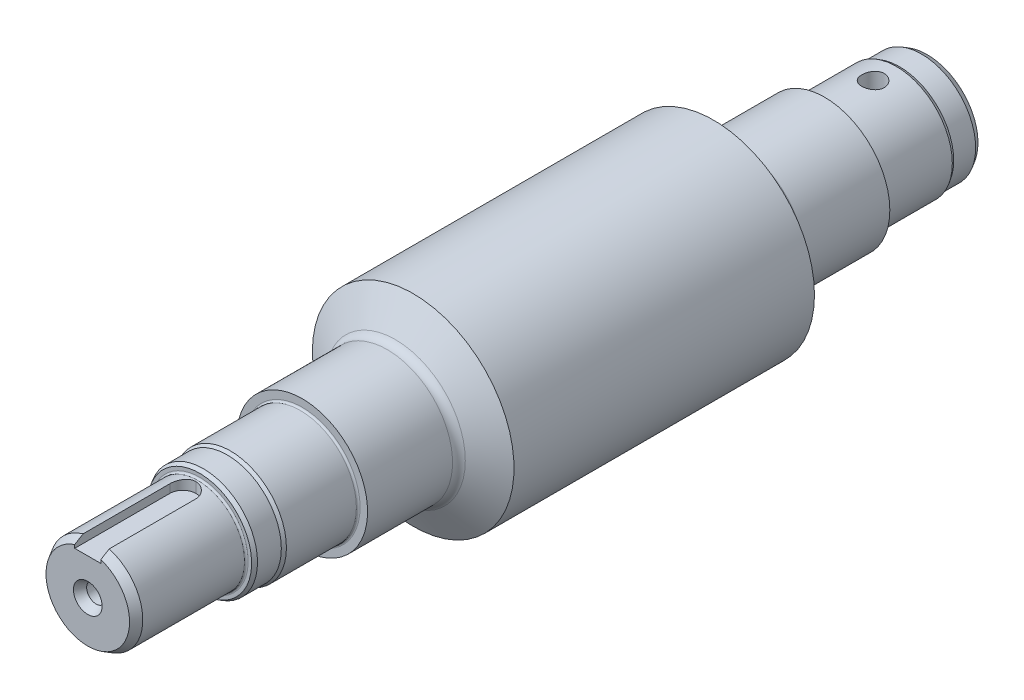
ISO-10303-21;
HEADER;
FILE_DESCRIPTION(('STEP AP214'),'2;1');
FILE_NAME('part.step','',(''),(''),'','','');
FILE_SCHEMA(('AUTOMOTIVE_DESIGN { 1 0 10303 214 1 1 1 1 }'));
ENDSEC;
DATA;
#1=APPLICATION_CONTEXT('core data for automotive mechanical design processes');
#2=APPLICATION_PROTOCOL_DEFINITION('international standard','automotive_design',2000,#1);
#3=PRODUCT_CONTEXT('',#1,'mechanical');
#4=PRODUCT('Part','Part','',(#3));
#5=PRODUCT_RELATED_PRODUCT_CATEGORY('part','',(#4));
#6=PRODUCT_DEFINITION_FORMATION('','',#4);
#7=PRODUCT_DEFINITION_CONTEXT('part definition',#1,'design');
#8=PRODUCT_DEFINITION('design','',#6,#7);
#9=PRODUCT_DEFINITION_SHAPE('','',#8);
#10=(LENGTH_UNIT() NAMED_UNIT(*) SI_UNIT(.MILLI.,.METRE.));
#11=(NAMED_UNIT(*) PLANE_ANGLE_UNIT() SI_UNIT($,.RADIAN.));
#12=(NAMED_UNIT(*) SI_UNIT($,.STERADIAN.) SOLID_ANGLE_UNIT());
#13=UNCERTAINTY_MEASURE_WITH_UNIT(LENGTH_MEASURE(1.E-05),#10,'distance_accuracy_value','');
#14=(GEOMETRIC_REPRESENTATION_CONTEXT(3) GLOBAL_UNCERTAINTY_ASSIGNED_CONTEXT((#13)) GLOBAL_UNIT_ASSIGNED_CONTEXT((#10,
#11,#12)) REPRESENTATION_CONTEXT('',''));
#15=CARTESIAN_POINT('',(0.,0.,0.));
#16=DIRECTION('',(0.,0.,1.));
#17=DIRECTION('',(1.,0.,0.));
#18=AXIS2_PLACEMENT_3D('',#15,#16,#17);
#19=CARTESIAN_POINT('',(0.,0.,145.52));
#20=DIRECTION('',(0.,0.,1.));
#21=DIRECTION('',(1.,0.,0.));
#22=AXIS2_PLACEMENT_3D('',#19,#20,#21);
#23=PLANE('',#22);
#24=CARTESIAN_POINT('',(0.,0.,145.52));
#25=DIRECTION('',(0.,0.,1.));
#26=DIRECTION('',(1.,0.,0.));
#27=AXIS2_PLACEMENT_3D('',#24,#25,#26);
#28=CIRCLE('',#27,31.);
#29=CARTESIAN_POINT('',(31.,0.,145.52));
#30=VERTEX_POINT('',#29);
#31=EDGE_CURVE('E224',#30,#30,#28,.F.);
#32=ORIENTED_EDGE('',*,*,#31,.T.);
#33=EDGE_LOOP('',(#32));
#34=FACE_BOUND('',#33,.T.);
#35=CARTESIAN_POINT('',(0.,0.,145.52));
#36=DIRECTION('',(0.,0.,1.));
#37=DIRECTION('',(1.,0.,0.));
#38=AXIS2_PLACEMENT_3D('',#35,#36,#37);
#39=CIRCLE('',#38,35.);
#40=CARTESIAN_POINT('',(-35.,0.,145.52));
#41=VERTEX_POINT('',#40);
#42=EDGE_CURVE('E339',#41,#41,#39,.T.);
#43=ORIENTED_EDGE('',*,*,#42,.T.);
#44=EDGE_LOOP('',(#43));
#45=FACE_BOUND('',#44,.T.);
#46=ADVANCED_FACE('F33',(#34,#45),#23,.T.);
#47=CARTESIAN_POINT('',(0.,0.,-134.48));
#48=DIRECTION('',(0.,0.,1.));
#49=DIRECTION('',(1.,0.,0.));
#50=AXIS2_PLACEMENT_3D('',#47,#48,#49);
#51=PLANE('',#50);
#52=CARTESIAN_POINT('',(0.,0.,-134.48));
#53=DIRECTION('',(0.,0.,1.));
#54=DIRECTION('',(1.,0.,0.));
#55=AXIS2_PLACEMENT_3D('',#52,#53,#54);
#56=CIRCLE('',#55,31.);
#57=CARTESIAN_POINT('',(31.,0.,-134.48));
#58=VERTEX_POINT('',#57);
#59=EDGE_CURVE('E230',#58,#58,#56,.T.);
#60=ORIENTED_EDGE('',*,*,#59,.T.);
#61=EDGE_LOOP('',(#60));
#62=FACE_BOUND('',#61,.T.);
#63=CARTESIAN_POINT('',(0.,0.,-134.48));
#64=DIRECTION('',(0.,0.,1.));
#65=DIRECTION('',(1.,0.,0.));
#66=AXIS2_PLACEMENT_3D('',#63,#64,#65);
#67=CIRCLE('',#66,35.);
#68=CARTESIAN_POINT('',(35.,0.,-134.48));
#69=VERTEX_POINT('',#68);
#70=EDGE_CURVE('E337',#69,#69,#67,.T.);
#71=ORIENTED_EDGE('',*,*,#70,.F.);
#72=EDGE_LOOP('',(#71));
#73=FACE_BOUND('',#72,.T.);
#74=ADVANCED_FACE('F295',(#62,#73),#51,.F.);
#75=CARTESIAN_POINT('',(0.,0.,100.));
#76=DIRECTION('',(0.,0.,-1.));
#77=DIRECTION('',(-1.,0.,0.));
#78=AXIS2_PLACEMENT_3D('',#75,#76,#77);
#79=CYLINDRICAL_SURFACE('',#78,54.069);
#80=CARTESIAN_POINT('',(0.,0.,-75.0175131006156));
#81=DIRECTION('',(0.,0.,1.));
#82=DIRECTION('',(1.,0.,0.));
#83=AXIS2_PLACEMENT_3D('',#80,#81,#82);
#84=CIRCLE('',#83,54.069);
#85=CARTESIAN_POINT('',(54.069,0.,-75.0175131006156));
#86=VERTEX_POINT('',#85);
#87=EDGE_CURVE('E360',#86,#86,#84,.F.);
#88=ORIENTED_EDGE('',*,*,#87,.F.);
#89=EDGE_LOOP('',(#88));
#90=FACE_BOUND('',#89,.T.);
#91=CARTESIAN_POINT('',(0.,0.,86.0575131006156));
#92=DIRECTION('',(0.,0.,-1.));
#93=DIRECTION('',(-1.,0.,0.));
#94=AXIS2_PLACEMENT_3D('',#91,#92,#93);
#95=CIRCLE('',#94,54.069);
#96=CARTESIAN_POINT('',(-54.069,0.,86.0575131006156));
#97=VERTEX_POINT('',#96);
#98=EDGE_CURVE('E355',#97,#97,#95,.F.);
#99=ORIENTED_EDGE('',*,*,#98,.F.);
#100=EDGE_LOOP('',(#99));
#101=FACE_BOUND('',#100,.T.);
#102=ADVANCED_FACE('F35',(#90,#101),#79,.T.);
#103=CARTESIAN_POINT('',(0.,0.,-74.48));
#104=DIRECTION('',(0.,0.,1.));
#105=DIRECTION('',(1.,0.,0.));
#106=AXIS2_PLACEMENT_3D('',#103,#104,#105);
#107=CONICAL_SURFACE('',#106,55.0000000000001,1.0471975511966);
#108=CARTESIAN_POINT('',(0.,0.,-84.5836297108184));
#109=DIRECTION('',(0.,0.,1.));
#110=DIRECTION('',(1.,0.,0.));
#111=AXIS2_PLACEMENT_3D('',#108,#109,#110);
#112=CIRCLE('',#111,37.5000000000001);
#113=CARTESIAN_POINT('',(37.5000000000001,0.,-84.5836297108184));
#114=VERTEX_POINT('',#113);
#115=EDGE_CURVE('E356',#114,#114,#112,.T.);
#116=ORIENTED_EDGE('',*,*,#115,.T.);
#117=EDGE_LOOP('',(#116));
#118=FACE_BOUND('',#117,.T.);
#119=ORIENTED_EDGE('',*,*,#87,.T.);
#120=EDGE_LOOP('',(#119));
#121=FACE_BOUND('',#120,.T.);
#122=ADVANCED_FACE('F319',(#118,#121),#107,.T.);
#123=CARTESIAN_POINT('',(0.,0.,-88.9137567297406));
#124=DIRECTION('',(0.,0.,1.));
#125=DIRECTION('',(1.,0.,0.));
#126=AXIS2_PLACEMENT_3D('',#123,#124,#125);
#127=TOROIDAL_SURFACE('',#126,40.0000000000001,5.);
#128=CARTESIAN_POINT('',(0.,0.,-88.9137567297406));
#129=DIRECTION('',(0.,0.,1.));
#130=DIRECTION('',(1.,0.,0.));
#131=AXIS2_PLACEMENT_3D('',#128,#129,#130);
#132=CIRCLE('',#131,35.0000000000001);
#133=CARTESIAN_POINT('',(35.,0.,-88.9137567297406));
#134=VERTEX_POINT('',#133);
#135=EDGE_CURVE('E334',#134,#134,#132,.T.);
#136=ORIENTED_EDGE('',*,*,#135,.T.);
#137=EDGE_LOOP('',(#136));
#138=FACE_BOUND('',#137,.T.);
#139=ORIENTED_EDGE('',*,*,#115,.F.);
#140=EDGE_LOOP('',(#139));
#141=FACE_BOUND('',#140,.T.);
#142=ADVANCED_FACE('F316',(#138,#141),#127,.F.);
#143=CARTESIAN_POINT('',(0.,0.,-125.52));
#144=DIRECTION('',(0.,0.,1.));
#145=DIRECTION('',(1.,0.,0.));
#146=AXIS2_PLACEMENT_3D('',#143,#144,#145);
#147=CYLINDRICAL_SURFACE('',#146,35.);
#148=CARTESIAN_POINT('',(35.,0.,-88.9137567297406));
#149=CARTESIAN_POINT('',(35.,0.,-89.3884050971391));
#150=CARTESIAN_POINT('',(35.,0.,-89.8630534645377));
#151=CARTESIAN_POINT('',(35.,0.,-90.8123501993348));
#152=CARTESIAN_POINT('',(35.,0.,-91.2869985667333));
#153=CARTESIAN_POINT('',(35.,0.,-92.2362953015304));
#154=CARTESIAN_POINT('',(35.,0.,-92.7109436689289));
#155=CARTESIAN_POINT('',(35.,0.,-93.660240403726));
#156=CARTESIAN_POINT('',(35.,0.,-94.1348887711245));
#157=CARTESIAN_POINT('',(35.,0.,-95.0841855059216));
#158=CARTESIAN_POINT('',(35.,0.,-95.5588338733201));
#159=CARTESIAN_POINT('',(35.,0.,-96.5081306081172));
#160=CARTESIAN_POINT('',(35.,0.,-96.9827789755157));
#161=CARTESIAN_POINT('',(35.,0.,-97.9320757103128));
#162=CARTESIAN_POINT('',(35.,0.,-98.4067240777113));
#163=CARTESIAN_POINT('',(35.,0.,-99.3560208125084));
#164=CARTESIAN_POINT('',(35.,0.,-99.8306691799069));
#165=CARTESIAN_POINT('',(35.,0.,-100.779965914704));
#166=CARTESIAN_POINT('',(35.,0.,-101.254614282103));
#167=CARTESIAN_POINT('',(35.,0.,-102.2039110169));
#168=CARTESIAN_POINT('',(35.,0.,-102.678559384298));
#169=CARTESIAN_POINT('',(35.,0.,-103.627856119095));
#170=CARTESIAN_POINT('',(35.,0.,-104.102504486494));
#171=CARTESIAN_POINT('',(35.,0.,-105.051801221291));
#172=CARTESIAN_POINT('',(35.,0.,-105.526449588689));
#173=CARTESIAN_POINT('',(35.,0.,-106.475746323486));
#174=CARTESIAN_POINT('',(35.,0.,-106.950394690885));
#175=CARTESIAN_POINT('',(35.,0.,-107.899691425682));
#176=CARTESIAN_POINT('',(35.,0.,-108.374339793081));
#177=CARTESIAN_POINT('',(35.,0.,-109.323636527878));
#178=CARTESIAN_POINT('',(35.,0.,-109.798284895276));
#179=CARTESIAN_POINT('',(35.,0.,-110.747581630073));
#180=CARTESIAN_POINT('',(35.,0.,-111.222229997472));
#181=CARTESIAN_POINT('',(35.,0.,-112.171526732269));
#182=CARTESIAN_POINT('',(35.,0.,-112.646175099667));
#183=CARTESIAN_POINT('',(35.,0.,-113.595471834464));
#184=CARTESIAN_POINT('',(35.,0.,-114.070120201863));
#185=CARTESIAN_POINT('',(35.,0.,-115.01941693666));
#186=CARTESIAN_POINT('',(35.,0.,-115.494065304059));
#187=CARTESIAN_POINT('',(35.,0.,-116.443362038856));
#188=CARTESIAN_POINT('',(35.,0.,-116.918010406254));
#189=CARTESIAN_POINT('',(35.,0.,-117.867307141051));
#190=CARTESIAN_POINT('',(35.,0.,-118.34195550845));
#191=CARTESIAN_POINT('',(35.,0.,-119.291252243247));
#192=CARTESIAN_POINT('',(35.,0.,-119.765900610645));
#193=CARTESIAN_POINT('',(35.,0.,-120.715197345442));
#194=CARTESIAN_POINT('',(35.,0.,-121.189845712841));
#195=CARTESIAN_POINT('',(35.,0.,-122.139142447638));
#196=CARTESIAN_POINT('',(35.,0.,-122.613790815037));
#197=CARTESIAN_POINT('',(35.,0.,-123.563087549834));
#198=CARTESIAN_POINT('',(35.,0.,-124.037735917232));
#199=CARTESIAN_POINT('',(35.,0.,-124.987032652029));
#200=CARTESIAN_POINT('',(35.,0.,-125.461681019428));
#201=CARTESIAN_POINT('',(35.,0.,-126.410977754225));
#202=CARTESIAN_POINT('',(35.,0.,-126.885626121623));
#203=CARTESIAN_POINT('',(35.,0.,-127.834922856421));
#204=CARTESIAN_POINT('',(35.,0.,-128.309571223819));
#205=CARTESIAN_POINT('',(35.,0.,-129.258867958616));
#206=CARTESIAN_POINT('',(35.,0.,-129.733516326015));
#207=CARTESIAN_POINT('',(35.,0.,-130.682813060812));
#208=CARTESIAN_POINT('',(35.,0.,-131.15746142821));
#209=CARTESIAN_POINT('',(35.,0.,-132.106758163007));
#210=CARTESIAN_POINT('',(35.,0.,-132.581406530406));
#211=CARTESIAN_POINT('',(35.,0.,-133.530703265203));
#212=CARTESIAN_POINT('',(35.,0.,-134.005351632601));
#213=CARTESIAN_POINT('',(35.,0.,-134.48));
#214=B_SPLINE_CURVE_WITH_KNOTS('',3,(#148,#149,#150,#151,#152,#153,#154,#155,#156,#157,#158,
#159,#160,#161,#162,#163,#164,#165,#166,#167,#168,#169,#170,#171,#172,#173,#174,#175,#176,#177,
#178,#179,#180,#181,#182,#183,#184,#185,#186,#187,#188,#189,#190,#191,#192,#193,#194,#195,#196,
#197,#198,#199,#200,#201,#202,#203,#204,#205,#206,#207,#208,#209,#210,#211,#212,#213),
.UNSPECIFIED.,.F.,.F.,(4,2,2,2,2,2,2,2,2,2,2,2,2,2,2,2,2,2,2,2,2,2,2,2,2,2,2,2,2,2,2,2,4),(0.,
1.42394510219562,2.84789020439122,4.27183530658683,5.69578040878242,7.11972551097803,
8.54367061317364,9.96761571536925,11.3915608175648,12.8155059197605,14.2394510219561,
15.6633961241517,17.0873412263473,18.5112863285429,19.9352314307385,21.3591765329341,
22.7831216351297,24.2070667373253,25.6310118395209,27.0549569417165,28.4789020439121,
29.9028471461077,31.3267922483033,32.7507373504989,34.1746824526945,35.5986275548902,
37.0225726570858,38.4465177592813,39.870462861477,41.2944079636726,42.7183530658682,
44.1422981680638,45.5662432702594),.UNSPECIFIED.);
#215=EDGE_CURVE('BSEAM314',#134,#69,#214,.T.);
#216=ORIENTED_EDGE('',*,*,#135,.F.);
#217=ORIENTED_EDGE('',*,*,#70,.T.);
#218=ORIENTED_EDGE('',*,*,#215,.T.);
#219=ORIENTED_EDGE('',*,*,#215,.F.);
#220=EDGE_LOOP('',(#216,#218,#217,#219));
#221=FACE_BOUND('',#220,.T.);
#222=ADVANCED_FACE('F314',(#221),#147,.T.);
#223=CARTESIAN_POINT('',(0.,0.,95.6236297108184));
#224=DIRECTION('',(0.,0.,-1.));
#225=DIRECTION('',(-1.,0.,0.));
#226=AXIS2_PLACEMENT_3D('',#223,#224,#225);
#227=CONICAL_SURFACE('',#226,37.5,1.0471975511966);
#228=CARTESIAN_POINT('',(0.,0.,95.6236297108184));
#229=DIRECTION('',(0.,0.,1.));
#230=DIRECTION('',(1.,0.,0.));
#231=AXIS2_PLACEMENT_3D('',#228,#229,#230);
#232=CIRCLE('',#231,37.5);
#233=CARTESIAN_POINT('',(37.5,0.,95.6236297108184));
#234=VERTEX_POINT('',#233);
#235=EDGE_CURVE('E352',#234,#234,#232,.T.);
#236=ORIENTED_EDGE('',*,*,#235,.F.);
#237=EDGE_LOOP('',(#236));
#238=FACE_BOUND('',#237,.T.);
#239=ORIENTED_EDGE('',*,*,#98,.T.);
#240=EDGE_LOOP('',(#239));
#241=FACE_BOUND('',#240,.T.);
#242=ADVANCED_FACE('F310',(#238,#241),#227,.T.);
#243=CARTESIAN_POINT('',(0.,0.,99.9537567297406));
#244=DIRECTION('',(0.,0.,1.));
#245=DIRECTION('',(1.,0.,0.));
#246=AXIS2_PLACEMENT_3D('',#243,#244,#245);
#247=TOROIDAL_SURFACE('',#246,40.,5.);
#248=ORIENTED_EDGE('',*,*,#235,.T.);
#249=EDGE_LOOP('',(#248));
#250=FACE_BOUND('',#249,.T.);
#251=CARTESIAN_POINT('',(0.,0.,99.9537567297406));
#252=DIRECTION('',(0.,0.,1.));
#253=DIRECTION('',(1.,0.,0.));
#254=AXIS2_PLACEMENT_3D('',#251,#252,#253);
#255=CIRCLE('',#254,35.);
#256=CARTESIAN_POINT('',(-35.,0.,99.9537567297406));
#257=VERTEX_POINT('',#256);
#258=EDGE_CURVE('E343',#257,#257,#255,.T.);
#259=ORIENTED_EDGE('',*,*,#258,.F.);
#260=EDGE_LOOP('',(#259));
#261=FACE_BOUND('',#260,.T.);
#262=ADVANCED_FACE('F306',(#250,#261),#247,.F.);
#263=CARTESIAN_POINT('',(0.,0.,125.52));
#264=DIRECTION('',(0.,0.,-1.));
#265=DIRECTION('',(-1.,0.,0.));
#266=AXIS2_PLACEMENT_3D('',#263,#264,#265);
#267=CYLINDRICAL_SURFACE('',#266,35.);
#268=CARTESIAN_POINT('',(-35.,0.,99.9537567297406));
#269=CARTESIAN_POINT('',(-35.,0.,100.428405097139));
#270=CARTESIAN_POINT('',(-35.,0.,100.903053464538));
#271=CARTESIAN_POINT('',(-35.,0.,101.852350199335));
#272=CARTESIAN_POINT('',(-35.,0.,102.326998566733));
#273=CARTESIAN_POINT('',(-35.,0.,103.27629530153));
#274=CARTESIAN_POINT('',(-35.,0.,103.750943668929));
#275=CARTESIAN_POINT('',(-35.,0.,104.700240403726));
#276=CARTESIAN_POINT('',(-35.,0.,105.174888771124));
#277=CARTESIAN_POINT('',(-35.,0.,106.124185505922));
#278=CARTESIAN_POINT('',(-35.,0.,106.59883387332));
#279=CARTESIAN_POINT('',(-35.,0.,107.548130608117));
#280=CARTESIAN_POINT('',(-35.,0.,108.022778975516));
#281=CARTESIAN_POINT('',(-35.,0.,108.972075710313));
#282=CARTESIAN_POINT('',(-35.,0.,109.446724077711));
#283=CARTESIAN_POINT('',(-35.,0.,110.396020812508));
#284=CARTESIAN_POINT('',(-35.,0.,110.870669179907));
#285=CARTESIAN_POINT('',(-35.,0.,111.819965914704));
#286=CARTESIAN_POINT('',(-35.,0.,112.294614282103));
#287=CARTESIAN_POINT('',(-35.,0.,113.2439110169));
#288=CARTESIAN_POINT('',(-35.,0.,113.718559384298));
#289=CARTESIAN_POINT('',(-35.,0.,114.667856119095));
#290=CARTESIAN_POINT('',(-35.,0.,115.142504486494));
#291=CARTESIAN_POINT('',(-35.,0.,116.091801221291));
#292=CARTESIAN_POINT('',(-35.,0.,116.566449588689));
#293=CARTESIAN_POINT('',(-35.,0.,117.515746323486));
#294=CARTESIAN_POINT('',(-35.,0.,117.990394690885));
#295=CARTESIAN_POINT('',(-35.,0.,118.939691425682));
#296=CARTESIAN_POINT('',(-35.,0.,119.414339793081));
#297=CARTESIAN_POINT('',(-35.,0.,120.363636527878));
#298=CARTESIAN_POINT('',(-35.,0.,120.838284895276));
#299=CARTESIAN_POINT('',(-35.,0.,121.787581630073));
#300=CARTESIAN_POINT('',(-35.,0.,122.262229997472));
#301=CARTESIAN_POINT('',(-35.,0.,123.211526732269));
#302=CARTESIAN_POINT('',(-35.,0.,123.686175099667));
#303=CARTESIAN_POINT('',(-35.,0.,124.635471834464));
#304=CARTESIAN_POINT('',(-35.,0.,125.110120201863));
#305=CARTESIAN_POINT('',(-35.,0.,126.05941693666));
#306=CARTESIAN_POINT('',(-35.,0.,126.534065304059));
#307=CARTESIAN_POINT('',(-35.,0.,127.483362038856));
#308=CARTESIAN_POINT('',(-35.,0.,127.958010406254));
#309=CARTESIAN_POINT('',(-35.,0.,128.907307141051));
#310=CARTESIAN_POINT('',(-35.,0.,129.38195550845));
#311=CARTESIAN_POINT('',(-35.,0.,130.331252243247));
#312=CARTESIAN_POINT('',(-35.,0.,130.805900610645));
#313=CARTESIAN_POINT('',(-35.,0.,131.755197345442));
#314=CARTESIAN_POINT('',(-35.,0.,132.229845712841));
#315=CARTESIAN_POINT('',(-35.,0.,133.179142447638));
#316=CARTESIAN_POINT('',(-35.,0.,133.653790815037));
#317=CARTESIAN_POINT('',(-35.,0.,134.603087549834));
#318=CARTESIAN_POINT('',(-35.,0.,135.077735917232));
#319=CARTESIAN_POINT('',(-35.,0.,136.027032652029));
#320=CARTESIAN_POINT('',(-35.,0.,136.501681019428));
#321=CARTESIAN_POINT('',(-35.,0.,137.450977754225));
#322=CARTESIAN_POINT('',(-35.,0.,137.925626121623));
#323=CARTESIAN_POINT('',(-35.,0.,138.874922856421));
#324=CARTESIAN_POINT('',(-35.,0.,139.349571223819));
#325=CARTESIAN_POINT('',(-35.,0.,140.298867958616));
#326=CARTESIAN_POINT('',(-35.,0.,140.773516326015));
#327=CARTESIAN_POINT('',(-35.,0.,141.722813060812));
#328=CARTESIAN_POINT('',(-35.,0.,142.19746142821));
#329=CARTESIAN_POINT('',(-35.,0.,143.146758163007));
#330=CARTESIAN_POINT('',(-35.,0.,143.621406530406));
#331=CARTESIAN_POINT('',(-35.,0.,144.570703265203));
#332=CARTESIAN_POINT('',(-35.,0.,145.045351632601));
#333=CARTESIAN_POINT('',(-35.,0.,145.52));
#334=B_SPLINE_CURVE_WITH_KNOTS('',3,(#268,#269,#270,#271,#272,#273,#274,#275,#276,#277,#278,
#279,#280,#281,#282,#283,#284,#285,#286,#287,#288,#289,#290,#291,#292,#293,#294,#295,#296,#297,
#298,#299,#300,#301,#302,#303,#304,#305,#306,#307,#308,#309,#310,#311,#312,#313,#314,#315,#316,
#317,#318,#319,#320,#321,#322,#323,#324,#325,#326,#327,#328,#329,#330,#331,#332,#333),
.UNSPECIFIED.,.F.,.F.,(4,2,2,2,2,2,2,2,2,2,2,2,2,2,2,2,2,2,2,2,2,2,2,2,2,2,2,2,2,2,2,2,4),(0.,
1.42394510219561,2.8478902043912,4.27183530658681,5.69578040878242,7.11972551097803,
8.54367061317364,9.96761571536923,11.3915608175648,12.8155059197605,14.2394510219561,
15.6633961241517,17.0873412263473,18.5112863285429,19.9352314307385,21.3591765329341,
22.7831216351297,24.2070667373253,25.6310118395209,27.0549569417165,28.4789020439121,
29.9028471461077,31.3267922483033,32.750737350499,34.1746824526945,35.5986275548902,
37.0225726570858,38.4465177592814,39.870462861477,41.2944079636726,42.7183530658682,
44.1422981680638,45.5662432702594),.UNSPECIFIED.);
#335=EDGE_CURVE('BSEAM309',#257,#41,#334,.T.);
#336=ORIENTED_EDGE('',*,*,#258,.T.);
#337=ORIENTED_EDGE('',*,*,#42,.F.);
#338=ORIENTED_EDGE('',*,*,#335,.T.);
#339=ORIENTED_EDGE('',*,*,#335,.F.);
#340=EDGE_LOOP('',(#336,#338,#337,#339));
#341=FACE_BOUND('',#340,.T.);
#342=ADVANCED_FACE('F309',(#341),#267,.T.);
#343=CARTESIAN_POINT('',(-29.,0.,-189.48));
#344=DIRECTION('',(0.,0.,1.));
#345=DIRECTION('',(1.,0.,0.));
#346=AXIS2_PLACEMENT_3D('',#343,#344,#345);
#347=PLANE('',#346);
#348=CARTESIAN_POINT('',(0.,0.,-189.48));
#349=DIRECTION('',(0.,0.,1.));
#350=DIRECTION('',(1.,0.,0.));
#351=AXIS2_PLACEMENT_3D('',#348,#349,#350);
#352=CIRCLE('',#351,27.267949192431);
#353=CARTESIAN_POINT('',(27.267949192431,0.,-189.48));
#354=VERTEX_POINT('',#353);
#355=EDGE_CURVE('E248',#354,#354,#352,.F.);
#356=ORIENTED_EDGE('',*,*,#355,.T.);
#357=EDGE_LOOP('',(#356));
#358=FACE_BOUND('',#357,.T.);
#359=DIRECTION('',(0.,1.,0.));
#360=VECTOR('',#359,1.);
#361=CARTESIAN_POINT('',(-4.00000000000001,18.3,-189.48));
#362=LINE('',#361,#360);
#363=CARTESIAN_POINT('',(-4.00000000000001,16.5227116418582,-189.48));
#364=VERTEX_POINT('',#363);
#365=CARTESIAN_POINT('',(-4.00000000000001,18.3,-189.48));
#366=VERTEX_POINT('',#365);
#367=EDGE_CURVE('E794',#364,#366,#362,.T.);
#368=ORIENTED_EDGE('',*,*,#367,.F.);
#369=CARTESIAN_POINT('',(0.,0.,-189.48));
#370=DIRECTION('',(0.,0.,1.));
#371=DIRECTION('',(1.,0.,0.));
#372=AXIS2_PLACEMENT_3D('',#369,#370,#371);
#373=CIRCLE('',#372,16.9999999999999);
#374=CARTESIAN_POINT('',(3.99999999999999,16.5227116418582,-189.48));
#375=VERTEX_POINT('',#374);
#376=EDGE_CURVE('E206',#364,#375,#373,.T.);
#377=ORIENTED_EDGE('',*,*,#376,.T.);
#378=DIRECTION('',(0.,-1.,0.));
#379=VECTOR('',#378,1.);
#380=CARTESIAN_POINT('',(3.99999999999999,18.3,-189.48));
#381=LINE('',#380,#379);
#382=CARTESIAN_POINT('',(3.99999999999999,18.3,-189.48));
#383=VERTEX_POINT('',#382);
#384=EDGE_CURVE('E790',#383,#375,#381,.T.);
#385=ORIENTED_EDGE('',*,*,#384,.F.);
#386=DIRECTION('',(1.,0.,0.));
#387=VECTOR('',#386,1.);
#388=CARTESIAN_POINT('',(3.99999999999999,18.3,-189.48));
#389=LINE('',#388,#387);
#390=EDGE_CURVE('E796',#366,#383,#389,.T.);
#391=ORIENTED_EDGE('',*,*,#390,.F.);
#392=EDGE_LOOP('',(#368,#377,#385,#391));
#393=FACE_BOUND('',#392,.T.);
#394=ADVANCED_FACE('F325',(#358,#393),#347,.F.);
#395=CARTESIAN_POINT('',(0.,0.,0.));
#396=DIRECTION('',(0.,0.,1.));
#397=DIRECTION('',(1.,0.,0.));
#398=AXIS2_PLACEMENT_3D('',#395,#396,#397);
#399=CYLINDRICAL_SURFACE('',#398,29.);
#400=CARTESIAN_POINT('',(0.,0.,-186.48));
#401=DIRECTION('',(0.,0.,1.));
#402=DIRECTION('',(1.,0.,0.));
#403=AXIS2_PLACEMENT_3D('',#400,#401,#402);
#404=CIRCLE('',#403,29.);
#405=CARTESIAN_POINT('',(29.,0.,-186.48));
#406=VERTEX_POINT('',#405);
#407=EDGE_CURVE('E245',#406,#406,#404,.T.);
#408=ORIENTED_EDGE('',*,*,#407,.T.);
#409=EDGE_LOOP('',(#408));
#410=FACE_BOUND('',#409,.T.);
#411=CARTESIAN_POINT('',(0.,0.,-174.712050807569));
#412=DIRECTION('',(0.,0.,1.));
#413=DIRECTION('',(1.,0.,0.));
#414=AXIS2_PLACEMENT_3D('',#411,#412,#413);
#415=CIRCLE('',#414,29.);
#416=CARTESIAN_POINT('',(29.,0.,-174.712050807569));
#417=VERTEX_POINT('',#416);
#418=EDGE_CURVE('E340',#417,#417,#415,.T.);
#419=ORIENTED_EDGE('',*,*,#418,.F.);
#420=EDGE_LOOP('',(#419));
#421=FACE_BOUND('',#420,.T.);
#422=ADVANCED_FACE('F412',(#410,#421),#399,.T.);
#423=CARTESIAN_POINT('',(0.,0.,-174.712050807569));
#424=DIRECTION('',(0.,0.,1.));
#425=DIRECTION('',(1.,0.,0.));
#426=AXIS2_PLACEMENT_3D('',#423,#424,#425);
#427=CONICAL_SURFACE('',#426,29.,0.523598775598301);
#428=CARTESIAN_POINT('',(0.,0.,-172.98));
#429=DIRECTION('',(0.,0.,1.));
#430=DIRECTION('',(1.,0.,0.));
#431=AXIS2_PLACEMENT_3D('',#428,#429,#430);
#432=CIRCLE('',#431,30.);
#433=CARTESIAN_POINT('',(30.,0.,-172.98));
#434=VERTEX_POINT('',#433);
#435=EDGE_CURVE('E346',#434,#434,#432,.T.);
#436=ORIENTED_EDGE('',*,*,#435,.F.);
#437=EDGE_LOOP('',(#436));
#438=FACE_BOUND('',#437,.T.);
#439=ORIENTED_EDGE('',*,*,#418,.T.);
#440=EDGE_LOOP('',(#439));
#441=FACE_BOUND('',#440,.T.);
#442=ADVANCED_FACE('F409',(#438,#441),#427,.T.);
#443=CARTESIAN_POINT('',(0.,0.,0.));
#444=DIRECTION('',(0.,0.,1.));
#445=DIRECTION('',(1.,0.,0.));
#446=AXIS2_PLACEMENT_3D('',#443,#444,#445);
#447=CYLINDRICAL_SURFACE('',#446,30.);
#448=CARTESIAN_POINT('',(0.,0.,-135.48));
#449=DIRECTION('',(0.,0.,1.));
#450=DIRECTION('',(1.,0.,0.));
#451=AXIS2_PLACEMENT_3D('',#448,#449,#450);
#452=CIRCLE('',#451,30.);
#453=CARTESIAN_POINT('',(30.,0.,-135.48));
#454=VERTEX_POINT('',#453);
#455=EDGE_CURVE('E227',#454,#454,#452,.F.);
#456=ORIENTED_EDGE('',*,*,#455,.T.);
#457=EDGE_LOOP('',(#456));
#458=FACE_BOUND('',#457,.T.);
#459=CARTESIAN_POINT('',(0.,30.,-166.48));
#460=CARTESIAN_POINT('',(0.166786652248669,30.0000016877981,-166.480003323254));
#461=CARTESIAN_POINT('',(0.333531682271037,29.9986067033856,-166.473043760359));
#462=CARTESIAN_POINT('',(0.665867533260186,29.9930693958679,-166.44526720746));
#463=CARTESIAN_POINT('',(0.831458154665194,29.9889266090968,-166.424447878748));
#464=CARTESIAN_POINT('',(1.16032458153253,29.9780042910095,-166.36909772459));
#465=CARTESIAN_POINT('',(1.32359914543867,29.9712233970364,-166.334559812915));
#466=CARTESIAN_POINT('',(1.64665330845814,29.9552115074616,-166.252030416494));
#467=CARTESIAN_POINT('',(1.80643159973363,29.9459796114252,-166.204033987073));
#468=CARTESIAN_POINT('',(2.12109983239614,29.9253365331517,-166.095035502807));
#469=CARTESIAN_POINT('',(2.27599604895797,29.9139282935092,-166.034050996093));
#470=CARTESIAN_POINT('',(2.58011997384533,29.8892333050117,-165.89946882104));
#471=CARTESIAN_POINT('',(2.72934556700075,29.8759458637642,-165.825866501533));
#472=CARTESIAN_POINT('',(3.02099738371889,29.847864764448,-165.66663348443));
#473=CARTESIAN_POINT('',(3.16342661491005,29.8330717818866,-165.581008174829));
#474=CARTESIAN_POINT('',(3.44066424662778,29.8023705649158,-165.398272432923));
#475=CARTESIAN_POINT('',(3.5754697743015,29.7864619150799,-165.301157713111));
#476=CARTESIAN_POINT('',(3.83805424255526,29.7537737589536,-165.094925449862));
#477=CARTESIAN_POINT('',(3.96573181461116,29.736986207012,-164.985680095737));
#478=CARTESIAN_POINT('',(4.21150797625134,29.7031748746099,-164.75684513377));
#479=CARTESIAN_POINT('',(4.32960299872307,29.6861510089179,-164.63725170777));
#480=CARTESIAN_POINT('',(4.55533107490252,29.6523520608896,-164.388598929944));
#481=CARTESIAN_POINT('',(4.66296713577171,29.6355769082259,-164.25954231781));
#482=CARTESIAN_POINT('',(4.86711503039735,29.6027344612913,-163.992750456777));
#483=CARTESIAN_POINT('',(4.96362274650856,29.5866674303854,-163.855012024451));
#484=CARTESIAN_POINT('',(5.14558410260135,29.555567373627,-163.570584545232));
#485=CARTESIAN_POINT('',(5.23093360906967,29.5405446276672,-163.423827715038));
#486=CARTESIAN_POINT('',(5.38897820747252,29.5121223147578,-163.12343216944));
#487=CARTESIAN_POINT('',(5.46166855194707,29.4987233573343,-162.969790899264));
#488=CARTESIAN_POINT('',(5.59377451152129,29.4739582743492,-162.656811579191));
#489=CARTESIAN_POINT('',(5.65319606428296,29.4625912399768,-162.497476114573));
#490=CARTESIAN_POINT('',(5.75835702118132,29.4422171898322,-162.174188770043));
#491=CARTESIAN_POINT('',(5.80409146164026,29.4332110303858,-162.010235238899));
#492=CARTESIAN_POINT('',(5.91908595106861,29.4103859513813,-161.517685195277));
#493=CARTESIAN_POINT('',(5.96802935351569,29.4003929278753,-161.183895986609));
#494=CARTESIAN_POINT('',(6.00933039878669,29.391977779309,-160.512889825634));
#495=CARTESIAN_POINT('',(6.00169382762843,29.3935544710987,-160.175673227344));
#496=CARTESIAN_POINT('',(5.93072281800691,29.4079543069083,-159.512532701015));
#497=CARTESIAN_POINT('',(5.86823000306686,29.4206075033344,-159.186515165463));
#498=CARTESIAN_POINT('',(5.69062854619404,29.4554724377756,-158.549699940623));
#499=CARTESIAN_POINT('',(5.57551739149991,29.4776846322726,-158.238902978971));
#500=CARTESIAN_POINT('',(5.29514836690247,29.5293371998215,-157.638909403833));
#501=CARTESIAN_POINT('',(5.12955681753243,29.5588254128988,-157.349872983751));
#502=CARTESIAN_POINT('',(4.75316153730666,29.6216771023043,-156.803374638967));
#503=CARTESIAN_POINT('',(4.54235261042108,29.6550410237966,-156.545916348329));
#504=CARTESIAN_POINT('',(4.07699958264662,29.7226212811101,-156.065023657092));
#505=CARTESIAN_POINT('',(3.82173696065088,29.7568421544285,-155.842284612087));
#506=CARTESIAN_POINT('',(3.27711015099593,29.8217309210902,-155.442676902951));
#507=CARTESIAN_POINT('',(2.98774552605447,29.8523987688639,-155.265808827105));
#508=CARTESIAN_POINT('',(2.38235631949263,29.9068014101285,-154.962834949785));
#509=CARTESIAN_POINT('',(2.06629091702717,29.9305253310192,-154.836808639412));
#510=CARTESIAN_POINT('',(1.41689385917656,29.9682845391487,-154.63983715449));
#511=CARTESIAN_POINT('',(1.0835643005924,29.9823210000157,-154.568885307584));
#512=CARTESIAN_POINT('',(0.415076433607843,29.9989603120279,-154.485061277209));
#513=CARTESIAN_POINT('',(0.0800419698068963,30.0017504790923,-154.471237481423));
#514=CARTESIAN_POINT('',(-0.587549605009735,29.996103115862,-154.499499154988));
#515=CARTESIAN_POINT('',(-0.920106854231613,29.987666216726,-154.541581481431));
#516=CARTESIAN_POINT('',(-1.57023396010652,29.960629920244,-154.679670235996));
#517=CARTESIAN_POINT('',(-1.8879116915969,29.9421225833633,-154.775188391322));
#518=CARTESIAN_POINT('',(-2.50274176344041,29.8970131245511,-155.016903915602));
#519=CARTESIAN_POINT('',(-2.79989256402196,29.8704103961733,-155.163105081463));
#520=CARTESIAN_POINT('',(-3.36924704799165,29.8115946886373,-155.504094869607));
#521=CARTESIAN_POINT('',(-3.64110078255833,29.7793170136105,-155.699456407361));
#522=CARTESIAN_POINT('',(-4.14850809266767,29.7128841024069,-156.132455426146));
#523=CARTESIAN_POINT('',(-4.38405777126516,29.6787286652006,-156.370097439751));
#524=CARTESIAN_POINT('',(-4.81584362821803,29.6117581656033,-156.885239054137));
#525=CARTESIAN_POINT('',(-5.0114265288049,29.5789714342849,-157.163290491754));
#526=CARTESIAN_POINT('',(-5.35311220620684,29.5190516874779,-157.748872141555));
#527=CARTESIAN_POINT('',(-5.49921696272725,29.4919184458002,-158.056401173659));
#528=CARTESIAN_POINT('',(-5.73691221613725,29.4466037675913,-158.690594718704));
#529=CARTESIAN_POINT('',(-5.82878534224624,29.4283760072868,-159.017150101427));
#530=CARTESIAN_POINT('',(-5.95624756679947,29.4028486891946,-159.681655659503));
#531=CARTESIAN_POINT('',(-5.99184400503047,29.3955477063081,-160.019604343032));
#532=CARTESIAN_POINT('',(-6.00215206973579,29.3934346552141,-160.524004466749));
#533=CARTESIAN_POINT('',(-5.99862026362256,29.3941596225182,-160.690271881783));
#534=CARTESIAN_POINT('',(-5.97778381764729,29.398405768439,-161.02188855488));
#535=CARTESIAN_POINT('',(-5.96048440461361,29.4019258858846,-161.18723813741));
#536=CARTESIAN_POINT('',(-5.91223531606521,29.4116654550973,-161.515898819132));
#537=CARTESIAN_POINT('',(-5.88128086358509,29.4178858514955,-161.679209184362));
#538=CARTESIAN_POINT('',(-5.80598159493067,29.4328396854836,-162.002535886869));
#539=CARTESIAN_POINT('',(-5.76164155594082,29.4415722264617,-162.162553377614));
#540=CARTESIAN_POINT('',(-5.66001374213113,29.4612782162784,-162.477907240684));
#541=CARTESIAN_POINT('',(-5.60275321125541,29.4722469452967,-162.633252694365));
#542=CARTESIAN_POINT('',(-5.47568162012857,29.4961198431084,-162.938502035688));
#543=CARTESIAN_POINT('',(-5.40587500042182,29.5090233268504,-163.088407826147));
#544=CARTESIAN_POINT('',(-5.25416908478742,29.5364122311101,-163.381897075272));
#545=CARTESIAN_POINT('',(-5.17226477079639,29.550898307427,-163.525477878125));
#546=CARTESIAN_POINT('',(-4.99698841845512,29.5810413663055,-163.805259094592));
#547=CARTESIAN_POINT('',(-4.90362031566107,29.5966979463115,-163.941462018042));
#548=CARTESIAN_POINT('',(-4.70431042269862,29.6290369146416,-164.207952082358));
#549=CARTESIAN_POINT('',(-4.59817846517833,29.6457323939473,-164.338095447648));
#550=CARTESIAN_POINT('',(-4.37544580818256,29.6794230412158,-164.588965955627));
#551=CARTESIAN_POINT('',(-4.25884879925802,29.696418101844,-164.709696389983));
#552=CARTESIAN_POINT('',(-4.01586865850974,29.7302514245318,-164.941048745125));
#553=CARTESIAN_POINT('',(-3.88947977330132,29.7470895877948,-165.051664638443));
#554=CARTESIAN_POINT('',(-3.62787334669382,29.7801260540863,-165.261912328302));
#555=CARTESIAN_POINT('',(-3.49265907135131,29.7963245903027,-165.361548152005));
#556=CARTESIAN_POINT('',(-3.21275204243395,29.8278103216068,-165.55020873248));
#557=CARTESIAN_POINT('',(-3.06797223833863,29.8430856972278,-165.639106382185));
#558=CARTESIAN_POINT('',(-2.77133359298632,29.8720925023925,-165.804333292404));
#559=CARTESIAN_POINT('',(-2.61947738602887,29.8858245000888,-165.880667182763));
#560=CARTESIAN_POINT('',(-2.30978799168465,29.9113522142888,-166.020189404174));
#561=CARTESIAN_POINT('',(-2.15195848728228,29.923149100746,-166.083385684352));
#562=CARTESIAN_POINT('',(-1.83142130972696,29.9444772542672,-166.196185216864));
#563=CARTESIAN_POINT('',(-1.66871458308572,29.9540089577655,-166.245791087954));
#564=CARTESIAN_POINT('',(-1.25904258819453,29.974570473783,-166.351867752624));
#565=CARTESIAN_POINT('',(-1.00974899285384,29.9840570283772,-166.399851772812));
#566=CARTESIAN_POINT('',(-0.506938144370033,29.9967704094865,-166.463914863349));
#567=CARTESIAN_POINT('',(-0.253421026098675,29.9999974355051,-166.47999495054));
#568=CARTESIAN_POINT('',(0.,30.,-166.48));
#569=B_SPLINE_CURVE_WITH_KNOTS('',3,(#459,#460,#461,#462,#463,#464,#465,#466,#467,#468,#469,
#470,#471,#472,#473,#474,#475,#476,#477,#478,#479,#480,#481,#482,#483,#484,#485,#486,#487,#488,
#489,#490,#491,#492,#493,#494,#495,#496,#497,#498,#499,#500,#501,#502,#503,#504,#505,#506,#507,
#508,#509,#510,#511,#512,#513,#514,#515,#516,#517,#518,#519,#520,#521,#522,#523,#524,#525,#526,
#527,#528,#529,#530,#531,#532,#533,#534,#535,#536,#537,#538,#539,#540,#541,#542,#543,#544,#545,
#546,#547,#548,#549,#550,#551,#552,#553,#554,#555,#556,#557,#558,#559,#560,#561,#562,#563,#564,
#565,#566,#567,#568),.UNSPECIFIED.,.T.,.F.,(4,2,2,2,2,2,2,2,2,2,2,2,2,2,2,2,2,2,2,2,2,2,2,2,2,2,
2,2,2,2,2,2,2,2,2,2,2,2,2,2,2,2,2,2,2,2,2,2,2,2,2,2,2,2,4),(0.,0.500137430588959,
1.00035927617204,1.50083984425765,2.0015045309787,2.50149701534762,3.00167420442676,
3.50162795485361,4.00176886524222,4.50779597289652,5.01401059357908,5.52007923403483,
6.02633453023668,6.53702041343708,7.04789740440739,7.55854532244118,8.06937820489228,
9.07654034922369,10.0835994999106,11.0754728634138,12.0673935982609,13.0660186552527,
14.0647585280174,15.0814643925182,16.0981832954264,17.1164857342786,18.1346647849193,
19.1358133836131,20.1369057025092,21.1289964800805,22.1211615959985,23.1254732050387,
24.1298925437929,25.1496069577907,26.1692805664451,27.1835921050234,28.1977713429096,
28.6962037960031,29.1944471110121,29.6928648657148,30.1911049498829,30.6883041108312,
31.1853276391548,31.6825579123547,32.1796179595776,32.6853083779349,33.1908211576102,
33.6966332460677,34.2022591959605,34.7133809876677,35.2243140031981,35.7349369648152,
36.2454614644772,37.0054106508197,37.7653356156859),.UNSPECIFIED.);
#570=CARTESIAN_POINT('',(0.,30.,-166.48));
#571=VERTEX_POINT('',#570);
#572=EDGE_CURVE('E169',#571,#571,#569,.T.);
#573=ORIENTED_EDGE('',*,*,#572,.T.);
#574=EDGE_LOOP('',(#573));
#575=FACE_BOUND('',#574,.T.);
#576=ORIENTED_EDGE('',*,*,#435,.T.);
#577=EDGE_LOOP('',(#576));
#578=FACE_BOUND('',#577,.T.);
#579=ADVANCED_FACE('F407',(#458,#575,#578),#447,.T.);
#580=CARTESIAN_POINT('',(0.,0.,0.));
#581=DIRECTION('',(0.,0.,1.));
#582=DIRECTION('',(1.,0.,0.));
#583=AXIS2_PLACEMENT_3D('',#580,#581,#582);
#584=CYLINDRICAL_SURFACE('',#583,30.);
#585=CARTESIAN_POINT('',(0.,0.,146.52));
#586=DIRECTION('',(0.,0.,1.));
#587=DIRECTION('',(1.,0.,0.));
#588=AXIS2_PLACEMENT_3D('',#585,#586,#587);
#589=CIRCLE('',#588,30.);
#590=CARTESIAN_POINT('',(30.,0.,146.52));
#591=VERTEX_POINT('',#590);
#592=EDGE_CURVE('E221',#591,#591,#589,.T.);
#593=ORIENTED_EDGE('',*,*,#592,.T.);
#594=EDGE_LOOP('',(#593));
#595=FACE_BOUND('',#594,.T.);
#596=CARTESIAN_POINT('',(0.,0.,184.02));
#597=DIRECTION('',(0.,0.,1.));
#598=DIRECTION('',(1.,0.,0.));
#599=AXIS2_PLACEMENT_3D('',#596,#597,#598);
#600=CIRCLE('',#599,30.);
#601=CARTESIAN_POINT('',(30.,0.,184.02));
#602=VERTEX_POINT('',#601);
#603=EDGE_CURVE('E402',#602,#602,#600,.T.);
#604=ORIENTED_EDGE('',*,*,#603,.F.);
#605=EDGE_LOOP('',(#604));
#606=FACE_BOUND('',#605,.T.);
#607=ADVANCED_FACE('F426',(#595,#606),#584,.T.);
#608=CARTESIAN_POINT('',(0.,0.,184.02));
#609=DIRECTION('',(0.,0.,-1.));
#610=DIRECTION('',(-1.,0.,0.));
#611=AXIS2_PLACEMENT_3D('',#608,#609,#610);
#612=CONICAL_SURFACE('',#611,30.,0.523598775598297);
#613=CARTESIAN_POINT('',(0.,0.,185.752050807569));
#614=DIRECTION('',(0.,0.,1.));
#615=DIRECTION('',(1.,0.,0.));
#616=AXIS2_PLACEMENT_3D('',#613,#614,#615);
#617=CIRCLE('',#616,29.);
#618=CARTESIAN_POINT('',(29.,0.,185.752050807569));
#619=VERTEX_POINT('',#618);
#620=EDGE_CURVE('E395',#619,#619,#617,.T.);
#621=ORIENTED_EDGE('',*,*,#620,.F.);
#622=EDGE_LOOP('',(#621));
#623=FACE_BOUND('',#622,.T.);
#624=ORIENTED_EDGE('',*,*,#603,.T.);
#625=EDGE_LOOP('',(#624));
#626=FACE_BOUND('',#625,.T.);
#627=ADVANCED_FACE('F430',(#623,#626),#612,.T.);
#628=CARTESIAN_POINT('',(0.,0.,0.));
#629=DIRECTION('',(0.,0.,1.));
#630=DIRECTION('',(1.,0.,0.));
#631=AXIS2_PLACEMENT_3D('',#628,#629,#630);
#632=CYLINDRICAL_SURFACE('',#631,29.);
#633=CARTESIAN_POINT('',(0.,0.,198.52));
#634=DIRECTION('',(0.,0.,-1.));
#635=DIRECTION('',(-1.,0.,0.));
#636=AXIS2_PLACEMENT_3D('',#633,#634,#635);
#637=CIRCLE('',#636,29.);
#638=CARTESIAN_POINT('',(-29.,0.,198.52));
#639=VERTEX_POINT('',#638);
#640=EDGE_CURVE('E236',#639,#639,#637,.T.);
#641=ORIENTED_EDGE('',*,*,#640,.T.);
#642=EDGE_LOOP('',(#641));
#643=FACE_BOUND('',#642,.T.);
#644=ORIENTED_EDGE('',*,*,#620,.T.);
#645=EDGE_LOOP('',(#644));
#646=FACE_BOUND('',#645,.T.);
#647=ADVANCED_FACE('F434',(#643,#646),#632,.T.);
#648=CARTESIAN_POINT('',(-29.,0.,200.52));
#649=DIRECTION('',(0.,0.,-1.));
#650=DIRECTION('',(-1.,0.,0.));
#651=AXIS2_PLACEMENT_3D('',#648,#649,#650);
#652=PLANE('',#651);
#653=CARTESIAN_POINT('',(0.,0.,200.52));
#654=DIRECTION('',(0.,0.,-1.));
#655=DIRECTION('',(-1.,0.,0.));
#656=AXIS2_PLACEMENT_3D('',#653,#654,#655);
#657=CIRCLE('',#656,27.8452994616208);
#658=CARTESIAN_POINT('',(-27.8452994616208,0.,200.52));
#659=VERTEX_POINT('',#658);
#660=EDGE_CURVE('E233',#659,#659,#657,.F.);
#661=ORIENTED_EDGE('',*,*,#660,.T.);
#662=EDGE_LOOP('',(#661));
#663=FACE_BOUND('',#662,.T.);
#664=CARTESIAN_POINT('',(0.,0.,200.52));
#665=DIRECTION('',(0.,0.,-1.));
#666=DIRECTION('',(-1.,0.,0.));
#667=AXIS2_PLACEMENT_3D('',#664,#665,#666);
#668=CIRCLE('',#667,26.);
#669=CARTESIAN_POINT('',(-26.,0.,200.52));
#670=VERTEX_POINT('',#669);
#671=EDGE_CURVE('E218',#670,#670,#668,.T.);
#672=ORIENTED_EDGE('',*,*,#671,.T.);
#673=EDGE_LOOP('',(#672));
#674=FACE_BOUND('',#673,.T.);
#675=ADVANCED_FACE('F438',(#663,#674),#652,.F.);
#676=CARTESIAN_POINT('',(0.,0.,0.));
#677=DIRECTION('',(0.,0.,1.));
#678=DIRECTION('',(1.,0.,0.));
#679=AXIS2_PLACEMENT_3D('',#676,#677,#678);
#680=CYLINDRICAL_SURFACE('',#679,25.);
#681=CARTESIAN_POINT('',(0.,0.,256.02));
#682=DIRECTION('',(0.,0.,-1.));
#683=DIRECTION('',(-1.,0.,0.));
#684=AXIS2_PLACEMENT_3D('',#681,#682,#683);
#685=CIRCLE('',#684,25.);
#686=CARTESIAN_POINT('',(7.,24.,256.02));
#687=VERTEX_POINT('',#686);
#688=CARTESIAN_POINT('',(-7.,24.,256.02));
#689=VERTEX_POINT('',#688);
#690=EDGE_CURVE('E242',#687,#689,#685,.T.);
#691=ORIENTED_EDGE('',*,*,#690,.T.);
#692=DIRECTION('',(0.,0.,1.));
#693=VECTOR('',#692,1.);
#694=CARTESIAN_POINT('',(-7.,24.,0.));
#695=LINE('',#694,#693);
#696=CARTESIAN_POINT('',(-7.,24.,209.52));
#697=VERTEX_POINT('',#696);
#698=EDGE_CURVE('E153',#689,#697,#695,.F.);
#699=ORIENTED_EDGE('',*,*,#698,.T.);
#700=CARTESIAN_POINT('',(-7.,24.,209.52));
#701=CARTESIAN_POINT('',(-7.00002540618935,23.9999745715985,209.327259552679));
#702=CARTESIAN_POINT('',(-6.99204067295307,24.002320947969,209.134528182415));
#703=CARTESIAN_POINT('',(-6.96023853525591,24.0115718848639,208.750523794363));
#704=CARTESIAN_POINT('',(-6.93642430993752,24.0184755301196,208.559250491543));
#705=CARTESIAN_POINT('',(-6.87322541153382,24.0366342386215,208.179972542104));
#706=CARTESIAN_POINT('',(-6.83387766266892,24.0478789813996,207.991961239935));
#707=CARTESIAN_POINT('',(-6.73995820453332,24.0743713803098,207.620068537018));
#708=CARTESIAN_POINT('',(-6.68538617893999,24.0896191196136,207.436187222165));
#709=CARTESIAN_POINT('',(-6.5614953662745,24.1236584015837,207.073897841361));
#710=CARTESIAN_POINT('',(-6.49218328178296,24.1424483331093,206.89548732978));
#711=CARTESIAN_POINT('',(-6.33931089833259,24.1830393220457,206.545159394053));
#712=CARTESIAN_POINT('',(-6.25574532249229,24.2048414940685,206.373244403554));
#713=CARTESIAN_POINT('',(-6.07499585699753,24.2508374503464,206.037063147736));
#714=CARTESIAN_POINT('',(-5.97781167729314,24.2750312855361,205.872797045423));
#715=CARTESIAN_POINT('',(-5.77046317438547,24.3251542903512,205.552871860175));
#716=CARTESIAN_POINT('',(-5.66029422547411,24.3510840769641,205.397215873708));
#717=CARTESIAN_POINT('',(-5.4248656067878,24.4046257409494,205.091804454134));
#718=CARTESIAN_POINT('',(-5.29930162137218,24.4322632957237,204.94228802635));
#719=CARTESIAN_POINT('',(-5.03616165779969,24.4878572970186,204.654291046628));
#720=CARTESIAN_POINT('',(-4.89858551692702,24.5158137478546,204.515810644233));
#721=CARTESIAN_POINT('',(-4.6122505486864,24.5712924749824,204.250728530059));
#722=CARTESIAN_POINT('',(-4.4634876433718,24.5988145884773,204.124131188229));
#723=CARTESIAN_POINT('',(-4.15582215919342,24.6526574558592,203.883756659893));
#724=CARTESIAN_POINT('',(-3.99692313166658,24.6789786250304,203.769975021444));
#725=CARTESIAN_POINT('',(-3.66692011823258,24.7301856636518,203.553988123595));
#726=CARTESIAN_POINT('',(-3.4956446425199,24.7550359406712,203.452036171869));
#727=CARTESIAN_POINT('',(-3.14480227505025,24.802046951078,203.263010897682));
#728=CARTESIAN_POINT('',(-2.96523852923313,24.824208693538,203.175931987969));
#729=CARTESIAN_POINT('',(-2.59908510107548,24.8652097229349,203.01734459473));
#730=CARTESIAN_POINT('',(-2.41249884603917,24.8840506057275,202.945828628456));
#731=CARTESIAN_POINT('',(-2.03365960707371,24.9178738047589,202.818943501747));
#732=CARTESIAN_POINT('',(-1.84140803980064,24.9328570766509,202.763570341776));
#733=CARTESIAN_POINT('',(-1.37794659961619,24.9634474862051,202.651395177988));
#734=CARTESIAN_POINT('',(-1.10470612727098,24.9770942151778,202.602174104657));
#735=CARTESIAN_POINT('',(-0.6919672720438,24.9908027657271,202.552903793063));
#736=CARTESIAN_POINT('',(-0.553918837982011,24.9942453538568,202.540573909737));
#737=CARTESIAN_POINT('',(-0.27726135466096,24.9988455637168,202.524121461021));
#738=CARTESIAN_POINT('',(-0.138652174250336,25.0000026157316,202.520000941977));
#739=CARTESIAN_POINT('',(0.,25.,202.52));
#740=B_SPLINE_CURVE_WITH_KNOTS('',3,(#700,#701,#702,#703,#704,#705,#706,#707,#708,#709,#710,
#711,#712,#713,#714,#715,#716,#717,#718,#719,#720,#721,#722,#723,#724,#725,#726,#727,#728,#729,
#730,#731,#732,#733,#734,#735,#736,#737,#738,#739),.UNSPECIFIED.,.F.,.F.,(4,2,2,2,2,2,2,2,2,2,2,
2,2,2,2,2,2,2,2,4),(0.,0.578027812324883,1.1559395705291,1.73248578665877,2.30904398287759,
2.88534056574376,3.46185096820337,4.03837365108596,4.61510233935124,5.20600387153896,
5.79691340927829,6.38803940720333,6.97895942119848,7.58081904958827,8.18245208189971,
8.78379520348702,9.38498920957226,10.2165218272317,10.6322233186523,11.048028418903),.UNSPECIFIED.);
#741=CARTESIAN_POINT('',(0.,25.,202.52));
#742=VERTEX_POINT('',#741);
#743=EDGE_CURVE('E48',#697,#742,#740,.T.);
#744=ORIENTED_EDGE('',*,*,#743,.T.);
#745=CARTESIAN_POINT('',(0.,25.,202.52));
#746=CARTESIAN_POINT('',(0.192890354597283,25.0000218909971,202.519974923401));
#747=CARTESIAN_POINT('',(0.385772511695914,24.997768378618,202.527971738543));
#748=CARTESIAN_POINT('',(0.77008707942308,24.9888697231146,202.559824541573));
#749=CARTESIAN_POINT('',(0.961519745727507,24.9822253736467,202.583677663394));
#750=CARTESIAN_POINT('',(1.34114665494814,24.9647237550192,202.646987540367));
#751=CARTESIAN_POINT('',(1.52934719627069,24.9538759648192,202.68640919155));
#752=CARTESIAN_POINT('',(1.9016213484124,24.9282696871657,202.780512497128));
#753=CARTESIAN_POINT('',(2.08569489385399,24.9135111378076,202.835194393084));
#754=CARTESIAN_POINT('',(2.44838212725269,24.8804859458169,202.959348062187));
#755=CARTESIAN_POINT('',(2.62699775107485,24.8622205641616,203.028814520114));
#756=CARTESIAN_POINT('',(2.97771952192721,24.8226578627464,203.182033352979));
#757=CARTESIAN_POINT('',(3.14982323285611,24.8013594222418,203.265791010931));
#758=CARTESIAN_POINT('',(3.48634320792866,24.7562968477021,203.446950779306));
#759=CARTESIAN_POINT('',(3.65075974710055,24.7325328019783,203.544352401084));
#760=CARTESIAN_POINT('',(3.9709466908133,24.6831488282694,203.75215616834));
#761=CARTESIAN_POINT('',(4.12671398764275,24.6575282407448,203.862562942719));
#762=CARTESIAN_POINT('',(4.43198262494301,24.604513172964,204.098234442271));
#763=CARTESIAN_POINT('',(4.58126480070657,24.5770917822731,204.223777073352));
#764=CARTESIAN_POINT('',(4.86879017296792,24.5217520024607,204.486825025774));
#765=CARTESIAN_POINT('',(5.00703320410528,24.4938336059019,204.624330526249));
#766=CARTESIAN_POINT('',(5.27165107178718,24.4382484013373,204.910478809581));
#767=CARTESIAN_POINT('',(5.39802099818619,24.4105817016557,205.059126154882));
#768=CARTESIAN_POINT('',(5.63795571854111,24.3562842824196,205.366512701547));
#769=CARTESIAN_POINT('',(5.75152492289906,24.3296532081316,205.525248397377));
#770=CARTESIAN_POINT('',(5.96725958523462,24.2776517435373,205.855110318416));
#771=CARTESIAN_POINT('',(6.06915291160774,24.2523170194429,206.026420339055));
#772=CARTESIAN_POINT('',(6.25805756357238,24.2042602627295,206.377324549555));
#773=CARTESIAN_POINT('',(6.34507447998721,24.1815372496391,206.556915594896));
#774=CARTESIAN_POINT('',(6.50353470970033,24.1394027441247,206.923116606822));
#775=CARTESIAN_POINT('',(6.57498631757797,24.1199894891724,207.109722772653));
#776=CARTESIAN_POINT('',(6.7017451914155,24.0850766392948,207.488610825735));
#777=CARTESIAN_POINT('',(6.75705651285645,24.0695760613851,207.680891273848));
#778=CARTESIAN_POINT('',(6.86897410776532,24.0379254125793,208.143983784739));
#779=CARTESIAN_POINT('',(6.91805270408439,24.0237757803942,208.416818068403));
#780=CARTESIAN_POINT('',(6.96718495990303,24.009551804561,208.828965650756));
#781=CARTESIAN_POINT('',(6.97948143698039,24.005977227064,208.966826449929));
#782=CARTESIAN_POINT('',(6.99588958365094,24.0011993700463,209.243110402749));
#783=CARTESIAN_POINT('',(6.99999916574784,23.9999966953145,209.381533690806));
#784=CARTESIAN_POINT('',(7.,24.,209.52));
#785=B_SPLINE_CURVE_WITH_KNOTS('',3,(#745,#746,#747,#748,#749,#750,#751,#752,#753,#754,#755,
#756,#757,#758,#759,#760,#761,#762,#763,#764,#765,#766,#767,#768,#769,#770,#771,#772,#773,#774,
#775,#776,#777,#778,#779,#780,#781,#782,#783,#784),.UNSPECIFIED.,.F.,.F.,(4,2,2,2,2,2,2,2,2,2,2,
2,2,2,2,2,2,2,2,4),(0.,0.578479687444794,1.15685484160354,1.73393325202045,2.31102079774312,
2.88790122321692,3.46499536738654,4.0420688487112,4.61934835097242,5.20958720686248,
5.79983490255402,6.39032563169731,6.9806122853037,7.58265389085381,8.18446873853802,
8.78596209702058,9.38730419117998,10.2176399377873,10.6327814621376,11.048028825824),.UNSPECIFIED.);
#786=CARTESIAN_POINT('',(6.99999999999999,24.,209.52));
#787=VERTEX_POINT('',#786);
#788=EDGE_CURVE('E450',#742,#787,#785,.T.);
#789=ORIENTED_EDGE('',*,*,#788,.T.);
#790=DIRECTION('',(0.,0.,1.));
#791=VECTOR('',#790,1.);
#792=CARTESIAN_POINT('',(6.99999999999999,24.,0.));
#793=LINE('',#792,#791);
#794=EDGE_CURVE('E150',#787,#687,#793,.T.);
#795=ORIENTED_EDGE('',*,*,#794,.T.);
#796=EDGE_LOOP('',(#691,#699,#744,#789,#795));
#797=FACE_BOUND('',#796,.T.);
#798=CARTESIAN_POINT('',(0.,0.,201.52));
#799=DIRECTION('',(0.,0.,-1.));
#800=DIRECTION('',(-1.,0.,0.));
#801=AXIS2_PLACEMENT_3D('',#798,#799,#800);
#802=CIRCLE('',#801,25.);
#803=CARTESIAN_POINT('',(-25.,0.,201.52));
#804=VERTEX_POINT('',#803);
#805=EDGE_CURVE('E215',#804,#804,#802,.F.);
#806=ORIENTED_EDGE('',*,*,#805,.T.);
#807=EDGE_LOOP('',(#806));
#808=FACE_BOUND('',#807,.T.);
#809=ADVANCED_FACE('F442',(#797,#808),#680,.T.);
#810=CARTESIAN_POINT('',(-25.,0.,260.52));
#811=DIRECTION('',(0.,0.,-1.));
#812=DIRECTION('',(-1.,0.,0.));
#813=AXIS2_PLACEMENT_3D('',#810,#811,#812);
#814=PLANE('',#813);
#815=CARTESIAN_POINT('',(0.,0.,260.52));
#816=DIRECTION('',(0.,0.,-1.));
#817=DIRECTION('',(-1.,0.,0.));
#818=AXIS2_PLACEMENT_3D('',#815,#816,#817);
#819=CIRCLE('',#818,7.69807621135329);
#820=CARTESIAN_POINT('',(-7.69807621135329,0.,260.52));
#821=VERTEX_POINT('',#820);
#822=EDGE_CURVE('E12',#821,#821,#819,.T.);
#823=ORIENTED_EDGE('',*,*,#822,.T.);
#824=EDGE_LOOP('',(#823));
#825=FACE_BOUND('',#824,.T.);
#826=DIRECTION('',(1.,0.,0.));
#827=VECTOR('',#826,1.);
#828=CARTESIAN_POINT('',(-7.,19.5,260.52));
#829=LINE('',#828,#827);
#830=CARTESIAN_POINT('',(-7.,19.5,260.52));
#831=VERTEX_POINT('',#830);
#832=CARTESIAN_POINT('',(7.,19.5,260.52));
#833=VERTEX_POINT('',#832);
#834=EDGE_CURVE('E142',#831,#833,#829,.T.);
#835=ORIENTED_EDGE('',*,*,#834,.F.);
#836=DIRECTION('',(0.,-1.,0.));
#837=VECTOR('',#836,1.);
#838=CARTESIAN_POINT('',(-7.00000000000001,43.9220489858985,260.52));
#839=LINE('',#838,#837);
#840=CARTESIAN_POINT('',(-7.,21.2801830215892,260.52));
#841=VERTEX_POINT('',#840);
#842=EDGE_CURVE('E137',#841,#831,#839,.T.);
#843=ORIENTED_EDGE('',*,*,#842,.F.);
#844=CARTESIAN_POINT('',(0.,0.,260.52));
#845=DIRECTION('',(0.,0.,-1.));
#846=DIRECTION('',(-1.,0.,0.));
#847=AXIS2_PLACEMENT_3D('',#844,#845,#846);
#848=CIRCLE('',#847,22.4019237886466);
#849=CARTESIAN_POINT('',(7.,21.2801830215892,260.52));
#850=VERTEX_POINT('',#849);
#851=EDGE_CURVE('E239',#841,#850,#848,.F.);
#852=ORIENTED_EDGE('',*,*,#851,.T.);
#853=DIRECTION('',(0.,1.,0.));
#854=VECTOR('',#853,1.);
#855=CARTESIAN_POINT('',(6.99999999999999,43.9220489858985,260.52));
#856=LINE('',#855,#854);
#857=EDGE_CURVE('E145',#833,#850,#856,.T.);
#858=ORIENTED_EDGE('',*,*,#857,.F.);
#859=EDGE_LOOP('',(#835,#843,#852,#858));
#860=FACE_BOUND('',#859,.T.);
#861=ADVANCED_FACE('F447',(#825,#860),#814,.F.);
#862=CARTESIAN_POINT('',(0.,0.,-154.48));
#863=DIRECTION('',(0.,0.,-1.));
#864=DIRECTION('',(-1.,0.,0.));
#865=AXIS2_PLACEMENT_3D('',#862,#863,#864);
#866=PLANE('',#865);
#867=CARTESIAN_POINT('',(0.,0.,-154.48));
#868=DIRECTION('',(0.,0.,-1.));
#869=DIRECTION('',(-1.,0.,0.));
#870=AXIS2_PLACEMENT_3D('',#867,#868,#869);
#871=CIRCLE('',#870,11.);
#872=CARTESIAN_POINT('',(-11.,0.,-154.48));
#873=VERTEX_POINT('',#872);
#874=EDGE_CURVE('E391',#873,#873,#871,.F.);
#875=ORIENTED_EDGE('',*,*,#874,.T.);
#876=EDGE_LOOP('',(#875));
#877=FACE_BOUND('',#876,.T.);
#878=CARTESIAN_POINT('',(0.,0.,-154.48));
#879=DIRECTION('',(0.,0.,-1.));
#880=DIRECTION('',(-1.,0.,0.));
#881=AXIS2_PLACEMENT_3D('',#878,#879,#880);
#882=CIRCLE('',#881,15.);
#883=CARTESIAN_POINT('',(0.,15.,-154.48));
#884=VERTEX_POINT('',#883);
#885=EDGE_CURVE('E388',#884,#884,#882,.T.);
#886=ORIENTED_EDGE('',*,*,#885,.T.);
#887=EDGE_LOOP('',(#886));
#888=FACE_BOUND('',#887,.T.);
#889=ADVANCED_FACE('F390',(#877,#888),#866,.T.);
#890=CARTESIAN_POINT('',(0.,0.,-154.48));
#891=DIRECTION('',(0.,0.,-1.));
#892=DIRECTION('',(-1.,0.,0.));
#893=AXIS2_PLACEMENT_3D('',#890,#891,#892);
#894=CYLINDRICAL_SURFACE('',#893,15.);
#895=DIRECTION('',(0.,0.,-1.));
#896=VECTOR('',#895,1.);
#897=CARTESIAN_POINT('',(3.99999999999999,14.456832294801,-154.48));
#898=LINE('',#897,#896);
#899=CARTESIAN_POINT('',(3.99999999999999,14.456832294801,-164.952135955));
#900=VERTEX_POINT('',#899);
#901=CARTESIAN_POINT('',(3.99999999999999,14.456832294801,-187.48));
#902=VERTEX_POINT('',#901);
#903=EDGE_CURVE('E367',#900,#902,#898,.T.);
#904=ORIENTED_EDGE('',*,*,#903,.T.);
#905=CARTESIAN_POINT('',(0.,0.,-187.48));
#906=DIRECTION('',(0.,0.,1.));
#907=DIRECTION('',(1.,0.,0.));
#908=AXIS2_PLACEMENT_3D('',#905,#906,#907);
#909=CIRCLE('',#908,15.);
#910=CARTESIAN_POINT('',(-4.00000000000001,14.456832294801,-187.48));
#911=VERTEX_POINT('',#910);
#912=EDGE_CURVE('E207',#902,#911,#909,.F.);
#913=ORIENTED_EDGE('',*,*,#912,.T.);
#914=DIRECTION('',(0.,0.,-1.));
#915=VECTOR('',#914,1.);
#916=CARTESIAN_POINT('',(-4.00000000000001,14.456832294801,-154.48));
#917=LINE('',#916,#915);
#918=CARTESIAN_POINT('',(-4.00000000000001,14.456832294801,-164.952135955));
#919=VERTEX_POINT('',#918);
#920=EDGE_CURVE('E363',#911,#919,#917,.F.);
#921=ORIENTED_EDGE('',*,*,#920,.T.);
#922=CARTESIAN_POINT('',(0.,15.,-154.48));
#923=CARTESIAN_POINT('',(0.161313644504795,14.9999992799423,-154.480000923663));
#924=CARTESIAN_POINT('',(0.322689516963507,14.9973905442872,-154.486514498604));
#925=CARTESIAN_POINT('',(0.644299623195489,14.9870209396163,-154.512510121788));
#926=CARTESIAN_POINT('',(0.804533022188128,14.9792566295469,-154.532000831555));
#927=CARTESIAN_POINT('',(1.12295032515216,14.9587594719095,-154.58381038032));
#928=CARTESIAN_POINT('',(1.28112908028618,14.9460159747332,-154.616156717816));
#929=CARTESIAN_POINT('',(1.59401110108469,14.9158923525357,-154.693368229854));
#930=CARTESIAN_POINT('',(1.74871291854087,14.8985103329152,-154.738238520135));
#931=CARTESIAN_POINT('',(2.05297112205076,14.85963474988,-154.839881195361));
#932=CARTESIAN_POINT('',(2.20254446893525,14.8381566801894,-154.896608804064));
#933=CARTESIAN_POINT('',(2.49626491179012,14.7915782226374,-155.021598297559));
#934=CARTESIAN_POINT('',(2.64040995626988,14.7664764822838,-155.089864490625));
#935=CARTESIAN_POINT('',(2.92227692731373,14.7132880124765,-155.237331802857));
#936=CARTESIAN_POINT('',(3.06000372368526,14.6852036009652,-155.316524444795));
#937=CARTESIAN_POINT('',(3.32842124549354,14.6267056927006,-155.485324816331));
#938=CARTESIAN_POINT('',(3.45910939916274,14.5962913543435,-155.574936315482));
#939=CARTESIAN_POINT('',(3.85034630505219,14.4999578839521,-155.866599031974));
#940=CARTESIAN_POINT('',(4.09812078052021,14.4312855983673,-156.085248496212));
#941=CARTESIAN_POINT('',(4.55459108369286,14.2938006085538,-156.560271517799));
#942=CARTESIAN_POINT('',(4.76326779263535,14.2249878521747,-156.816663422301));
#943=CARTESIAN_POINT('',(5.04723766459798,14.1257237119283,-157.231124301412));
#944=CARTESIAN_POINT('',(5.13866506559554,14.0926348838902,-157.377735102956));
#945=CARTESIAN_POINT('',(5.30875946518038,14.0294439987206,-157.678764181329));
#946=CARTESIAN_POINT('',(5.38743171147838,13.9993407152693,-157.833179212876));
#947=CARTESIAN_POINT('',(5.53135072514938,13.9431035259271,-158.148850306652));
#948=CARTESIAN_POINT('',(5.59659658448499,13.9169698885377,-158.310106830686));
#949=CARTESIAN_POINT('',(5.71298893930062,13.8695965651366,-158.638250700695));
#950=CARTESIAN_POINT('',(5.76414249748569,13.8483544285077,-158.805135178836));
#951=CARTESIAN_POINT('',(5.84985002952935,13.812361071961,-159.135719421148));
#952=CARTESIAN_POINT('',(5.88504634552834,13.7973611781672,-159.29922559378));
#953=CARTESIAN_POINT('',(5.94169028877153,13.7730632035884,-159.628952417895));
#954=CARTESIAN_POINT('',(5.96314412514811,13.763762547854,-159.79517180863));
#955=CARTESIAN_POINT('',(5.99206783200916,13.7511953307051,-160.129015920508));
#956=CARTESIAN_POINT('',(5.99954065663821,13.7479274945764,-160.296640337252));
#957=CARTESIAN_POINT('',(6.00041818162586,13.7475446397,-160.631929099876));
#958=CARTESIAN_POINT('',(5.99382353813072,13.7504293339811,-160.799593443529));
#959=CARTESIAN_POINT('',(5.96760177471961,13.7618280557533,-161.121884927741));
#960=CARTESIAN_POINT('',(5.94891756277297,13.7699346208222,-161.276604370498));
#961=CARTESIAN_POINT('',(5.89963965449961,13.7911192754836,-161.583840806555));
#962=CARTESIAN_POINT('',(5.86904203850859,13.8041990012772,-161.73635705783));
#963=CARTESIAN_POINT('',(5.79624600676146,13.8349228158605,-162.038079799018));
#964=CARTESIAN_POINT('',(5.75405038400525,13.8525658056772,-162.187287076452));
#965=CARTESIAN_POINT('',(5.6584179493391,13.8919033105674,-162.481562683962));
#966=CARTESIAN_POINT('',(5.60497681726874,13.9135993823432,-162.626629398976));
#967=CARTESIAN_POINT('',(5.4861207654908,13.9608971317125,-162.914589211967));
#968=CARTESIAN_POINT('',(5.42048769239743,13.9865682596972,-163.057380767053));
#969=CARTESIAN_POINT('',(5.27846344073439,14.0407834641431,-163.336995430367));
#970=CARTESIAN_POINT('',(5.20206861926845,14.0693285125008,-163.473816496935));
#971=CARTESIAN_POINT('',(5.03904071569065,14.1285380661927,-163.740756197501));
#972=CARTESIAN_POINT('',(4.95240626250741,14.1592028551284,-163.870873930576));
#973=CARTESIAN_POINT('',(4.7694272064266,14.2218815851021,-164.123751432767));
#974=CARTESIAN_POINT('',(4.67308210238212,14.2538955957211,-164.24651082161));
#975=CARTESIAN_POINT('',(4.46337699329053,14.321009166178,-164.493287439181));
#976=CARTESIAN_POINT('',(4.34927691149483,14.3561554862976,-164.616664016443));
#977=CARTESIAN_POINT('',(4.11112913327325,14.4261573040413,-164.85341997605));
#978=CARTESIAN_POINT('',(3.98708438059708,14.46101288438,-164.96680229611));
#979=CARTESIAN_POINT('',(3.72964838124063,14.5295379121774,-165.182976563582));
#980=CARTESIAN_POINT('',(3.59625179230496,14.563206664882,-165.28576237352));
#981=CARTESIAN_POINT('',(3.32099627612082,14.6284304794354,-165.479933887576));
#982=CARTESIAN_POINT('',(3.1791407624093,14.6599863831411,-165.571324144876));
#983=CARTESIAN_POINT('',(2.88480363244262,14.7207656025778,-165.743799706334));
#984=CARTESIAN_POINT('',(2.73216491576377,14.7499286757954,-165.824638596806));
#985=CARTESIAN_POINT('',(2.41997061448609,14.8043518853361,-165.973050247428));
#986=CARTESIAN_POINT('',(2.26041784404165,14.8296135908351,-166.040628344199));
#987=CARTESIAN_POINT('',(1.93550182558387,14.875508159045,-166.161891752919));
#988=CARTESIAN_POINT('',(1.77013973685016,14.8961419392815,-166.215579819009));
#989=CARTESIAN_POINT('',(1.4348478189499,14.9321676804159,-166.308504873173));
#990=CARTESIAN_POINT('',(1.26491830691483,14.9475600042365,-166.347742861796));
#991=CARTESIAN_POINT('',(0.932043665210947,14.9718895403,-166.409437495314));
#992=CARTESIAN_POINT('',(0.769280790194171,14.9811550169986,-166.432750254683));
#993=CARTESIAN_POINT('',(0.442179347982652,14.9943744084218,-166.465941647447));
#994=CARTESIAN_POINT('',(0.277840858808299,14.9983285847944,-166.475820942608));
#995=CARTESIAN_POINT('',(-0.0510959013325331,15.000814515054,-166.482036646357));
#996=CARTESIAN_POINT('',(-0.215694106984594,14.9993474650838,-166.478376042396));
#997=CARTESIAN_POINT('',(-0.543895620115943,14.9910347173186,-166.457559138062));
#998=CARTESIAN_POINT('',(-0.707498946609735,14.9841891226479,-166.440403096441));
#999=CARTESIAN_POINT('',(-1.02510006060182,14.9657383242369,-166.393861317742));
#1000=CARTESIAN_POINT('',(-1.17919782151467,14.9543621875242,-166.365063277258));
#1001=CARTESIAN_POINT('',(-1.48434586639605,14.9271627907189,-166.295600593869));
#1002=CARTESIAN_POINT('',(-1.63539513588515,14.9113380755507,-166.254932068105));
#1003=CARTESIAN_POINT('',(-1.93337901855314,14.8756364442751,-166.16211166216));
#1004=CARTESIAN_POINT('',(-2.08031476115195,14.8557606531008,-166.109962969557));
#1005=CARTESIAN_POINT('',(-2.36928412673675,14.8124221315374,-165.994590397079));
#1006=CARTESIAN_POINT('',(-2.51131586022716,14.788958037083,-165.931362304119));
#1007=CARTESIAN_POINT('',(-2.79382655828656,14.738240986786,-165.792256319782));
#1008=CARTESIAN_POINT('',(-2.93412902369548,14.7108949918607,-165.716054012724));
#1009=CARTESIAN_POINT('',(-3.2078834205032,14.653636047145,-165.552955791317));
#1010=CARTESIAN_POINT('',(-3.34133298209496,14.6237222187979,-165.466056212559));
#1011=CARTESIAN_POINT('',(-3.60064969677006,14.5620427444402,-165.282144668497));
#1012=CARTESIAN_POINT('',(-3.72651556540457,14.5302767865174,-165.185130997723));
#1013=CARTESIAN_POINT('',(-3.97000140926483,14.4656475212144,-164.981585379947));
#1014=CARTESIAN_POINT('',(-4.08762102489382,14.4327841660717,-164.875053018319));
#1015=CARTESIAN_POINT('',(-4.32151965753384,14.3645492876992,-164.64569829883));
#1016=CARTESIAN_POINT('',(-4.43719333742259,14.3291558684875,-164.522264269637));
#1017=CARTESIAN_POINT('',(-4.65775251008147,14.2589878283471,-164.266015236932));
#1018=CARTESIAN_POINT('',(-4.76264135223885,14.2242130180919,-164.133203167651));
#1019=CARTESIAN_POINT('',(-4.9610580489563,14.1562321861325,-163.858842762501));
#1020=CARTESIAN_POINT('',(-5.05457937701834,14.1230270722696,-163.717289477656));
#1021=CARTESIAN_POINT('',(-5.22948651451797,14.0592011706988,-163.42639783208));
#1022=CARTESIAN_POINT('',(-5.31087742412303,14.0285792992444,-163.277062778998));
#1023=CARTESIAN_POINT('',(-5.46168285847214,13.9705625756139,-162.969897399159));
#1024=CARTESIAN_POINT('',(-5.53096653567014,13.9432038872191,-162.81199586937));
#1025=CARTESIAN_POINT('',(-5.65585321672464,13.8930146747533,-162.49024592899));
#1026=CARTESIAN_POINT('',(-5.71146207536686,13.8701822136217,-162.326400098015));
#1027=CARTESIAN_POINT('',(-5.80843082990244,13.8298551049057,-161.993967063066));
#1028=CARTESIAN_POINT('',(-5.84979637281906,13.8123583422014,-161.82538176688));
#1029=CARTESIAN_POINT('',(-5.91782050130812,13.7833513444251,-161.484765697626));
#1030=CARTESIAN_POINT('',(-5.94448031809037,13.7718406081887,-161.312735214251));
#1031=CARTESIAN_POINT('',(-5.98138158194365,13.755851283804,-160.979171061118));
#1032=CARTESIAN_POINT('',(-5.99266704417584,13.7509260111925,-160.817773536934));
#1033=CARTESIAN_POINT('',(-6.00216046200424,13.7467850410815,-160.494523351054));
#1034=CARTESIAN_POINT('',(-6.00036897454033,13.7475691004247,-160.332670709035));
#1035=CARTESIAN_POINT('',(-5.98373064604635,13.7548190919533,-160.009788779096));
#1036=CARTESIAN_POINT('',(-5.96888538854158,13.7612843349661,-159.848759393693));
#1037=CARTESIAN_POINT('',(-5.9263097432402,13.7796730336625,-159.52873222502));
#1038=CARTESIAN_POINT('',(-5.89857941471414,13.7915964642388,-159.36973443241));
#1039=CARTESIAN_POINT('',(-5.83188915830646,13.8199248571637,-159.06120488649));
#1040=CARTESIAN_POINT('',(-5.79342041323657,13.8361324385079,-158.911548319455));
#1041=CARTESIAN_POINT('',(-5.70522097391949,13.872733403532,-158.616069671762));
#1042=CARTESIAN_POINT('',(-5.65548660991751,13.8931281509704,-158.470248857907));
#1043=CARTESIAN_POINT('',(-5.54517998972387,13.9375216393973,-158.183352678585));
#1044=CARTESIAN_POINT('',(-5.48460916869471,13.9615199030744,-158.042276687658));
#1045=CARTESIAN_POINT('',(-5.35307990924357,14.0124768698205,-157.765588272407));
#1046=CARTESIAN_POINT('',(-5.28211769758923,14.0394366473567,-157.629977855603));
#1047=CARTESIAN_POINT('',(-5.04570156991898,14.1269314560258,-157.21733558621));
#1048=CARTESIAN_POINT('',(-4.86295379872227,14.1914514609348,-156.950814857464));
#1049=CARTESIAN_POINT('',(-4.45761854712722,14.3239291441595,-156.450949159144));
#1050=CARTESIAN_POINT('',(-4.23501905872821,14.3918878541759,-156.217614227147));
#1051=CARTESIAN_POINT('',(-3.86726006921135,14.4935144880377,-155.889388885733));
#1052=CARTESIAN_POINT('',(-3.73448315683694,14.5283750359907,-155.780733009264));
#1053=CARTESIAN_POINT('',(-3.45982226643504,14.596218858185,-155.574998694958));
#1054=CARTESIAN_POINT('',(-3.31794165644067,14.6292028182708,-155.477916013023));
#1055=CARTESIAN_POINT('',(-3.02578567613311,14.692412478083,-155.295959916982));
#1056=CARTESIAN_POINT('',(-2.87550254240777,14.7226355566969,-155.211098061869));
#1057=CARTESIAN_POINT('',(-2.56769193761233,14.7794259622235,-155.054434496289));
#1058=CARTESIAN_POINT('',(-2.41016781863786,14.8059949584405,-154.982626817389));
#1059=CARTESIAN_POINT('',(-2.09182205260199,14.8542831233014,-154.853880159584));
#1060=CARTESIAN_POINT('',(-1.93111197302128,14.8760814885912,-154.796695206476));
#1061=CARTESIAN_POINT('',(-1.60493222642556,14.9147961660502,-154.696117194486));
#1062=CARTESIAN_POINT('',(-1.4394648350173,14.9317147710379,-154.652717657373));
#1063=CARTESIAN_POINT('',(-1.1054147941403,14.9601501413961,-154.580237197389));
#1064=CARTESIAN_POINT('',(-0.936841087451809,14.9716804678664,-154.551120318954));
#1065=CARTESIAN_POINT('',(-0.597618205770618,14.9890510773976,-154.507390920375));
#1066=CARTESIAN_POINT('',(-0.426970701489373,14.9948956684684,-154.492767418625));
#1067=CARTESIAN_POINT('',(-0.21339042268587,14.9985429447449,-154.483643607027));
#1068=CARTESIAN_POINT('',(-0.170726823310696,14.9990891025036,-154.48227755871));
#1069=CARTESIAN_POINT('',(-0.0853769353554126,14.9998177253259,-154.480455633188));
#1070=CARTESIAN_POINT('',(-0.0426906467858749,15.0000001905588,-154.479999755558));
#1071=CARTESIAN_POINT('',(0.,15.,-154.48));
#1072=B_SPLINE_CURVE_WITH_KNOTS('',3,(#922,#923,#924,#925,#926,#927,#928,#929,#930,#931,#932,
#933,#934,#935,#936,#937,#938,#939,#940,#941,#942,#943,#944,#945,#946,#947,#948,#949,#950,#951,
#952,#953,#954,#955,#956,#957,#958,#959,#960,#961,#962,#963,#964,#965,#966,#967,#968,#969,#970,
#971,#972,#973,#974,#975,#976,#977,#978,#979,#980,#981,#982,#983,#984,#985,#986,#987,#988,#989,
#990,#991,#992,#993,#994,#995,#996,#997,#998,#999,#1000,#1001,#1002,#1003,#1004,#1005,#1006,
#1007,#1008,#1009,#1010,#1011,#1012,#1013,#1014,#1015,#1016,#1017,#1018,#1019,#1020,#1021,#1022,
#1023,#1024,#1025,#1026,#1027,#1028,#1029,#1030,#1031,#1032,#1033,#1034,#1035,#1036,#1037,#1038,
#1039,#1040,#1041,#1042,#1043,#1044,#1045,#1046,#1047,#1048,#1049,#1050,#1051,#1052,#1053,#1054,
#1055,#1056,#1057,#1058,#1059,#1060,#1061,#1062,#1063,#1064,#1065,#1066,#1067,#1068,#1069,#1070,
#1071),.UNSPECIFIED.,.T.,.F.,(4,2,2,2,2,2,2,2,2,2,2,2,2,2,2,2,2,2,2,2,2,2,2,2,2,2,2,2,2,2,2,2,2,
2,2,2,2,2,2,2,2,2,2,2,2,2,2,2,2,2,2,2,2,2,2,2,2,2,2,2,2,2,2,2,2,2,2,2,2,2,2,2,2,2,4),(0.,
0.483897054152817,0.968117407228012,1.45337914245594,1.93883938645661,2.42249849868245,
2.9063385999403,3.38980540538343,3.87344767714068,4.88128652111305,5.88961691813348,
6.41682474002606,6.94381510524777,7.4708410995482,7.99760247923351,8.5007058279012,
9.00358170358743,9.50635131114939,10.0090974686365,10.4767118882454,10.9444802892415,
11.4121361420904,11.8799719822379,12.3571671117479,12.8345241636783,13.3119452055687,
13.7893908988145,14.3038604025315,14.8181781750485,15.3327921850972,15.8471999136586,
16.3720340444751,16.8966565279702,17.4211749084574,17.945656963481,18.4390821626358,
18.9324830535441,19.4257750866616,19.9190576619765,20.3900487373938,20.8611940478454,
21.3322087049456,21.8034028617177,22.2888301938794,22.7744242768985,23.2601003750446,
23.7457976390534,24.2636804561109,24.7814019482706,25.299419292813,25.8172182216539,
26.3403070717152,26.8631715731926,27.3858285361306,27.9084417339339,28.3934227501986,
28.8783831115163,29.3632846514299,29.8481839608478,30.3137727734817,30.7795134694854,
31.2451925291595,31.7110411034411,32.695156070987,33.6795680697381,34.2042554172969,
34.7287497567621,35.2537369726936,35.7784835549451,36.2937161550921,36.8087062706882,
37.3223931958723,37.8356906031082,37.9637509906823,38.0918113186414),.UNSPECIFIED.);
#1073=EDGE_CURVE('E161',#919,#884,#1072,.T.);
#1074=ORIENTED_EDGE('',*,*,#1073,.T.);
#1075=ORIENTED_EDGE('',*,*,#885,.F.);
#1076=EDGE_CURVE('E168',#884,#900,#1072,.T.);
#1077=ORIENTED_EDGE('',*,*,#1076,.T.);
#1078=EDGE_LOOP('',(#904,#913,#921,#1074,#1075,#1077));
#1079=FACE_BOUND('',#1078,.T.);
#1080=ADVANCED_FACE('F174',(#1079),#894,.F.);
#1081=CARTESIAN_POINT('',(0.,0.,-154.48));
#1082=DIRECTION('',(0.,0.,-1.));
#1083=DIRECTION('',(-1.,0.,0.));
#1084=AXIS2_PLACEMENT_3D('',#1081,#1082,#1083);
#1085=CONICAL_SURFACE('',#1084,11.,1.02974425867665);
#1086=CARTESIAN_POINT('',(0.,0.,-147.870533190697));
#1087=VERTEX_POINT('',#1086);
#1088=VERTEX_LOOP('',#1087);
#1089=FACE_BOUND('',#1088,.T.);
#1090=ORIENTED_EDGE('',*,*,#874,.F.);
#1091=EDGE_LOOP('',(#1090));
#1092=FACE_BOUND('',#1091,.T.);
#1093=ADVANCED_FACE('F617',(#1089,#1092),#1085,.F.);
#1094=CARTESIAN_POINT('',(3.99999999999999,18.3,-160.48));
#1095=DIRECTION('',(1.,0.,0.));
#1096=DIRECTION('',(0.,1.,0.));
#1097=AXIS2_PLACEMENT_3D('',#1094,#1095,#1096);
#1098=PLANE('',#1097);
#1099=ORIENTED_EDGE('',*,*,#384,.T.);
#1100=CARTESIAN_POINT('',(3.99999999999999,16.5227116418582,-189.48));
#1101=CARTESIAN_POINT('',(3.99999999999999,16.3508823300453,-189.312995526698));
#1102=CARTESIAN_POINT('',(3.99999999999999,16.1789815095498,-189.146064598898));
#1103=CARTESIAN_POINT('',(3.99999999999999,15.8350219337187,-188.812365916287));
#1104=CARTESIAN_POINT('',(3.99999999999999,15.6629631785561,-188.645598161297));
#1105=CARTESIAN_POINT('',(3.99999999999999,15.3186724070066,-188.312241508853));
#1106=CARTESIAN_POINT('',(3.99999999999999,15.1464403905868,-188.145652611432));
#1107=CARTESIAN_POINT('',(3.99999999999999,14.8017846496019,-187.81267287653));
#1108=CARTESIAN_POINT('',(3.99999999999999,14.629360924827,-187.646282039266));
#1109=CARTESIAN_POINT('',(3.99999999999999,14.456832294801,-187.48));
#1110=B_SPLINE_CURVE_WITH_KNOTS('',3,(#1100,#1101,#1102,#1103,#1104,#1105,#1106,#1107,#1108,
#1109),.UNSPECIFIED.,.F.,.F.,(4,2,2,2,4),(0.,0.718847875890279,1.43769496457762,2.1565421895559,
2.87539020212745),.UNSPECIFIED.);
#1111=EDGE_CURVE('E210',#375,#902,#1110,.T.);
#1112=ORIENTED_EDGE('',*,*,#1111,.T.);
#1113=ORIENTED_EDGE('',*,*,#903,.F.);
#1114=DIRECTION('',(0.,-1.,0.));
#1115=VECTOR('',#1114,1.);
#1116=CARTESIAN_POINT('',(3.99999999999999,54.069,-164.952135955));
#1117=LINE('',#1116,#1115);
#1118=CARTESIAN_POINT('',(3.99999999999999,18.3,-164.952135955));
#1119=VERTEX_POINT('',#1118);
#1120=EDGE_CURVE('E158',#900,#1119,#1117,.F.);
#1121=ORIENTED_EDGE('',*,*,#1120,.T.);
#1122=DIRECTION('',(0.,0.,-1.));
#1123=VECTOR('',#1122,1.);
#1124=CARTESIAN_POINT('',(3.99999999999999,18.3,-160.48));
#1125=LINE('',#1124,#1123);
#1126=EDGE_CURVE('E392',#1119,#383,#1125,.T.);
#1127=ORIENTED_EDGE('',*,*,#1126,.T.);
#1128=EDGE_LOOP('',(#1099,#1112,#1113,#1121,#1127));
#1129=FACE_BOUND('',#1128,.T.);
#1130=ADVANCED_FACE('F196',(#1129),#1098,.F.);
#1131=CARTESIAN_POINT('',(-4.00000000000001,18.3,-160.48));
#1132=DIRECTION('',(-1.,0.,0.));
#1133=DIRECTION('',(0.,0.,1.));
#1134=AXIS2_PLACEMENT_3D('',#1131,#1132,#1133);
#1135=PLANE('',#1134);
#1136=ORIENTED_EDGE('',*,*,#920,.F.);
#1137=CARTESIAN_POINT('',(-4.00000000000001,14.456832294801,-187.48));
#1138=CARTESIAN_POINT('',(-4.00000000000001,14.629360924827,-187.646282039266));
#1139=CARTESIAN_POINT('',(-4.00000000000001,14.8017846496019,-187.81267287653));
#1140=CARTESIAN_POINT('',(-4.00000000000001,15.1464403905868,-188.145652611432));
#1141=CARTESIAN_POINT('',(-4.00000000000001,15.3186724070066,-188.312241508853));
#1142=CARTESIAN_POINT('',(-4.00000000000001,15.6629631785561,-188.645598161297));
#1143=CARTESIAN_POINT('',(-4.00000000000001,15.8350219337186,-188.812365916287));
#1144=CARTESIAN_POINT('',(-4.00000000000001,16.1789815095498,-189.146064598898));
#1145=CARTESIAN_POINT('',(-4.00000000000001,16.3508823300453,-189.312995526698));
#1146=CARTESIAN_POINT('',(-4.00000000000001,16.5227116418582,-189.48));
#1147=B_SPLINE_CURVE_WITH_KNOTS('',3,(#1137,#1138,#1139,#1140,#1141,#1142,#1143,#1144,#1145,
#1146),.UNSPECIFIED.,.F.,.F.,(4,2,2,2,4),(0.,0.718848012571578,1.43769523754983,
2.15654232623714,2.87539020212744),.UNSPECIFIED.);
#1148=EDGE_CURVE('E200',#911,#364,#1147,.T.);
#1149=ORIENTED_EDGE('',*,*,#1148,.T.);
#1150=ORIENTED_EDGE('',*,*,#367,.T.);
#1151=DIRECTION('',(0.,0.,-1.));
#1152=VECTOR('',#1151,1.);
#1153=CARTESIAN_POINT('',(-4.00000000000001,18.3,-160.48));
#1154=LINE('',#1153,#1152);
#1155=CARTESIAN_POINT('',(-4.00000000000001,18.3,-164.952135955));
#1156=VERTEX_POINT('',#1155);
#1157=EDGE_CURVE('E384',#1156,#366,#1154,.T.);
#1158=ORIENTED_EDGE('',*,*,#1157,.F.);
#1159=DIRECTION('',(0.,-1.,0.));
#1160=VECTOR('',#1159,1.);
#1161=CARTESIAN_POINT('',(-4.00000000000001,54.069,-164.952135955));
#1162=LINE('',#1161,#1160);
#1163=EDGE_CURVE('E155',#1156,#919,#1162,.T.);
#1164=ORIENTED_EDGE('',*,*,#1163,.T.);
#1165=EDGE_LOOP('',(#1136,#1149,#1150,#1158,#1164));
#1166=FACE_BOUND('',#1165,.T.);
#1167=ADVANCED_FACE('F191',(#1166),#1135,.F.);
#1168=CARTESIAN_POINT('',(3.99999999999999,18.3,-160.48));
#1169=DIRECTION('',(0.,1.,0.));
#1170=DIRECTION('',(0.,0.,1.));
#1171=AXIS2_PLACEMENT_3D('',#1168,#1169,#1170);
#1172=PLANE('',#1171);
#1173=ORIENTED_EDGE('',*,*,#1126,.F.);
#1174=CARTESIAN_POINT('',(0.,18.3,-160.48));
#1175=DIRECTION('',(0.,1.,0.));
#1176=DIRECTION('',(0.,0.,1.));
#1177=AXIS2_PLACEMENT_3D('',#1174,#1175,#1176);
#1178=CIRCLE('',#1177,6.);
#1179=EDGE_CURVE('E369',#1119,#1156,#1178,.T.);
#1180=ORIENTED_EDGE('',*,*,#1179,.T.);
#1181=ORIENTED_EDGE('',*,*,#1157,.T.);
#1182=ORIENTED_EDGE('',*,*,#390,.T.);
#1183=EDGE_LOOP('',(#1173,#1180,#1181,#1182));
#1184=FACE_BOUND('',#1183,.T.);
#1185=ADVANCED_FACE('F184',(#1184),#1172,.F.);
#1186=CARTESIAN_POINT('',(0.,54.069,-160.48));
#1187=DIRECTION('',(0.,-1.,0.));
#1188=DIRECTION('',(0.,0.,-1.));
#1189=AXIS2_PLACEMENT_3D('',#1186,#1187,#1188);
#1190=CYLINDRICAL_SURFACE('',#1189,6.);
#1191=ORIENTED_EDGE('',*,*,#1073,.F.);
#1192=ORIENTED_EDGE('',*,*,#1163,.F.);
#1193=ORIENTED_EDGE('',*,*,#1179,.F.);
#1194=ORIENTED_EDGE('',*,*,#1120,.F.);
#1195=ORIENTED_EDGE('',*,*,#1076,.F.);
#1196=EDGE_LOOP('',(#1191,#1192,#1193,#1194,#1195));
#1197=FACE_BOUND('',#1196,.T.);
#1198=ORIENTED_EDGE('',*,*,#572,.F.);
#1199=EDGE_LOOP('',(#1198));
#1200=FACE_BOUND('',#1199,.T.);
#1201=ADVANCED_FACE('F178',(#1197,#1200),#1190,.F.);
#1202=CARTESIAN_POINT('',(0.,0.,-187.48));
#1203=DIRECTION('',(0.,0.,-1.));
#1204=DIRECTION('',(-1.,0.,0.));
#1205=AXIS2_PLACEMENT_3D('',#1202,#1203,#1204);
#1206=CONICAL_SURFACE('',#1205,15.,0.785398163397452);
#1207=ORIENTED_EDGE('',*,*,#1111,.F.);
#1208=ORIENTED_EDGE('',*,*,#376,.F.);
#1209=ORIENTED_EDGE('',*,*,#1148,.F.);
#1210=ORIENTED_EDGE('',*,*,#912,.F.);
#1211=EDGE_LOOP('',(#1207,#1208,#1209,#1210));
#1212=FACE_BOUND('',#1211,.T.);
#1213=ADVANCED_FACE('F183',(#1212),#1206,.F.);
#1214=CARTESIAN_POINT('',(0.,0.,201.52));
#1215=DIRECTION('',(0.,0.,-1.));
#1216=DIRECTION('',(-1.,0.,0.));
#1217=AXIS2_PLACEMENT_3D('',#1214,#1215,#1216);
#1218=TOROIDAL_SURFACE('',#1217,26.,1.);
#1219=ORIENTED_EDGE('',*,*,#671,.F.);
#1220=EDGE_LOOP('',(#1219));
#1221=FACE_BOUND('',#1220,.T.);
#1222=ORIENTED_EDGE('',*,*,#805,.F.);
#1223=EDGE_LOOP('',(#1222));
#1224=FACE_BOUND('',#1223,.T.);
#1225=ADVANCED_FACE('F501',(#1221,#1224),#1218,.F.);
#1226=CARTESIAN_POINT('',(0.,0.,146.52));
#1227=DIRECTION('',(0.,0.,1.));
#1228=DIRECTION('',(1.,0.,0.));
#1229=AXIS2_PLACEMENT_3D('',#1226,#1227,#1228);
#1230=TOROIDAL_SURFACE('',#1229,31.,1.);
#1231=ORIENTED_EDGE('',*,*,#31,.F.);
#1232=EDGE_LOOP('',(#1231));
#1233=FACE_BOUND('',#1232,.T.);
#1234=ORIENTED_EDGE('',*,*,#592,.F.);
#1235=EDGE_LOOP('',(#1234));
#1236=FACE_BOUND('',#1235,.T.);
#1237=ADVANCED_FACE('F503',(#1233,#1236),#1230,.F.);
#1238=CARTESIAN_POINT('',(0.,0.,-135.48));
#1239=DIRECTION('',(0.,0.,1.));
#1240=DIRECTION('',(1.,0.,0.));
#1241=AXIS2_PLACEMENT_3D('',#1238,#1239,#1240);
#1242=TOROIDAL_SURFACE('',#1241,31.,1.);
#1243=ORIENTED_EDGE('',*,*,#59,.F.);
#1244=EDGE_LOOP('',(#1243));
#1245=FACE_BOUND('',#1244,.T.);
#1246=ORIENTED_EDGE('',*,*,#455,.F.);
#1247=EDGE_LOOP('',(#1246));
#1248=FACE_BOUND('',#1247,.T.);
#1249=ADVANCED_FACE('F509',(#1245,#1248),#1242,.F.);
#1250=CARTESIAN_POINT('',(0.,0.,200.52));
#1251=DIRECTION('',(0.,0.,-1.));
#1252=DIRECTION('',(-1.,0.,0.));
#1253=AXIS2_PLACEMENT_3D('',#1250,#1251,#1252);
#1254=CONICAL_SURFACE('',#1253,27.8452994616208,0.523598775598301);
#1255=ORIENTED_EDGE('',*,*,#640,.F.);
#1256=EDGE_LOOP('',(#1255));
#1257=FACE_BOUND('',#1256,.T.);
#1258=ORIENTED_EDGE('',*,*,#660,.F.);
#1259=EDGE_LOOP('',(#1258));
#1260=FACE_BOUND('',#1259,.T.);
#1261=ADVANCED_FACE('F290',(#1257,#1260),#1254,.T.);
#1262=CARTESIAN_POINT('',(0.,0.,260.52));
#1263=DIRECTION('',(0.,0.,-1.));
#1264=DIRECTION('',(-1.,0.,0.));
#1265=AXIS2_PLACEMENT_3D('',#1262,#1263,#1264);
#1266=CONICAL_SURFACE('',#1265,22.4019237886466,0.523598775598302);
#1267=CARTESIAN_POINT('',(-7.,28.9454522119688,247.741064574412));
#1268=CARTESIAN_POINT('',(-7.,28.3788697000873,248.694887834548));
#1269=CARTESIAN_POINT('',(-7.,27.8116328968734,249.64832322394));
#1270=CARTESIAN_POINT('',(-7.,26.6755294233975,251.554222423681));
#1271=CARTESIAN_POINT('',(-7.,26.1066627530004,252.50668623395));
#1272=CARTESIAN_POINT('',(-7.,24.9670059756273,254.410400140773));
#1273=CARTESIAN_POINT('',(-7.,24.3962159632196,255.361650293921));
#1274=CARTESIAN_POINT('',(-7.,23.25224372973,257.262710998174));
#1275=CARTESIAN_POINT('',(-7.,22.6790615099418,258.212521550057));
#1276=CARTESIAN_POINT('',(-7.,21.5296990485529,260.11038529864));
#1277=CARTESIAN_POINT('',(-7.,20.9535186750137,261.058438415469));
#1278=CARTESIAN_POINT('',(-7.,19.7974052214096,262.952249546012));
#1279=CARTESIAN_POINT('',(-7.,19.2174721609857,263.898007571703));
#1280=CARTESIAN_POINT('',(-7.,18.3439107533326,265.31441935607));
#1281=CARTESIAN_POINT('',(-7.,18.0521057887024,265.786197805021));
#1282=CARTESIAN_POINT('',(-7.,17.467094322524,266.728884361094));
#1283=CARTESIAN_POINT('',(-7.,17.173887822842,267.199792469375));
#1284=CARTESIAN_POINT('',(-7.,16.5858556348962,268.140608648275));
#1285=CARTESIAN_POINT('',(-7.,16.2910299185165,268.610516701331));
#1286=CARTESIAN_POINT('',(-7.,15.6994843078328,269.549141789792));
#1287=CARTESIAN_POINT('',(-7.,15.4027644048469,270.017858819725));
#1288=CARTESIAN_POINT('',(-7.,15.1049587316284,270.485886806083));
#1289=B_SPLINE_CURVE_WITH_KNOTS('',3,(#1267,#1268,#1269,#1270,#1271,#1272,#1273,#1274,#1275,
#1276,#1277,#1278,#1279,#1280,#1281,#1282,#1283,#1284,#1285,#1286,#1287,#1288),.UNSPECIFIED.,
.F.,.F.,(4,2,2,2,2,2,2,2,2,2,4),(0.,3.32823616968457,6.65647261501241,9.98454773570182,
13.3126210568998,16.6408420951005,19.9690457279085,21.6332328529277,23.297417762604,
24.9616316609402,26.6258531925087),.UNSPECIFIED.);
#1290=EDGE_CURVE('E259',#689,#841,#1289,.T.);
#1291=ORIENTED_EDGE('',*,*,#1290,.F.);
#1292=ORIENTED_EDGE('',*,*,#690,.F.);
#1293=CARTESIAN_POINT('',(7.,15.1049587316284,270.485886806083));
#1294=CARTESIAN_POINT('',(7.,15.4027644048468,270.017858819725));
#1295=CARTESIAN_POINT('',(7.,15.6994843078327,269.549141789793));
#1296=CARTESIAN_POINT('',(7.,16.2910299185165,268.610516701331));
#1297=CARTESIAN_POINT('',(7.,16.5858556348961,268.140608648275));
#1298=CARTESIAN_POINT('',(7.,17.1738878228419,267.199792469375));
#1299=CARTESIAN_POINT('',(7.,17.4670943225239,266.728884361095));
#1300=CARTESIAN_POINT('',(7.,18.0521057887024,265.786197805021));
#1301=CARTESIAN_POINT('',(7.,18.3439107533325,265.31441935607));
#1302=CARTESIAN_POINT('',(7.,19.2174721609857,263.898007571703));
#1303=CARTESIAN_POINT('',(7.,19.7974052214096,262.952249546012));
#1304=CARTESIAN_POINT('',(7.,20.9535186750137,261.058438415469));
#1305=CARTESIAN_POINT('',(7.,21.5296990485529,260.11038529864));
#1306=CARTESIAN_POINT('',(7.,22.6790615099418,258.212521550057));
#1307=CARTESIAN_POINT('',(7.,23.2522437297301,257.262710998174));
#1308=CARTESIAN_POINT('',(7.,24.3962159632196,255.361650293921));
#1309=CARTESIAN_POINT('',(7.,24.9670059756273,254.410400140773));
#1310=CARTESIAN_POINT('',(7.,26.1066627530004,252.50668623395));
#1311=CARTESIAN_POINT('',(7.,26.6755294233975,251.554222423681));
#1312=CARTESIAN_POINT('',(7.,27.8116328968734,249.64832322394));
#1313=CARTESIAN_POINT('',(7.,28.3788697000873,248.694887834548));
#1314=CARTESIAN_POINT('',(7.,28.9454522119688,247.741064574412));
#1315=B_SPLINE_CURVE_WITH_KNOTS('',3,(#1293,#1294,#1295,#1296,#1297,#1298,#1299,#1300,#1301,
#1302,#1303,#1304,#1305,#1306,#1307,#1308,#1309,#1310,#1311,#1312,#1313,#1314),.UNSPECIFIED.,
.F.,.F.,(4,2,2,2,2,2,2,2,2,2,4),(0.,1.66422153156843,3.32843542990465,4.99262033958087,
6.65680746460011,9.98501109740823,13.313232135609,16.6413054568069,19.9693805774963,
23.2976170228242,26.6258531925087),.UNSPECIFIED.);
#1316=EDGE_CURVE('E251',#850,#687,#1315,.T.);
#1317=ORIENTED_EDGE('',*,*,#1316,.F.);
#1318=ORIENTED_EDGE('',*,*,#851,.F.);
#1319=EDGE_LOOP('',(#1291,#1292,#1317,#1318));
#1320=FACE_BOUND('',#1319,.T.);
#1321=ADVANCED_FACE('F265',(#1320),#1266,.T.);
#1322=CARTESIAN_POINT('',(0.,0.,-186.48));
#1323=DIRECTION('',(0.,0.,1.));
#1324=DIRECTION('',(1.,0.,0.));
#1325=AXIS2_PLACEMENT_3D('',#1322,#1323,#1324);
#1326=CONICAL_SURFACE('',#1325,29.,0.523598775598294);
#1327=CARTESIAN_POINT('',(27.267949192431,0.,-189.48));
#1328=CARTESIAN_POINT('',(27.2859913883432,0.,-189.44875));
#1329=CARTESIAN_POINT('',(27.3040335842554,0.,-189.4175));
#1330=CARTESIAN_POINT('',(27.3401179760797,0.,-189.355));
#1331=CARTESIAN_POINT('',(27.3581601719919,0.,-189.32375));
#1332=CARTESIAN_POINT('',(27.3942445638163,0.,-189.26125));
#1333=CARTESIAN_POINT('',(27.4122867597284,0.,-189.23));
#1334=CARTESIAN_POINT('',(27.4483711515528,0.,-189.1675));
#1335=CARTESIAN_POINT('',(27.466413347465,0.,-189.13625));
#1336=CARTESIAN_POINT('',(27.5024977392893,0.,-189.07375));
#1337=CARTESIAN_POINT('',(27.5205399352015,0.,-189.0425));
#1338=CARTESIAN_POINT('',(27.5566243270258,0.,-188.98));
#1339=CARTESIAN_POINT('',(27.574666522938,0.,-188.94875));
#1340=CARTESIAN_POINT('',(27.6107509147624,0.,-188.88625));
#1341=CARTESIAN_POINT('',(27.6287931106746,0.,-188.855));
#1342=CARTESIAN_POINT('',(27.6648775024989,0.,-188.7925));
#1343=CARTESIAN_POINT('',(27.6829196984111,0.,-188.76125));
#1344=CARTESIAN_POINT('',(27.7190040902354,0.,-188.69875));
#1345=CARTESIAN_POINT('',(27.7370462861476,0.,-188.6675));
#1346=CARTESIAN_POINT('',(27.773130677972,0.,-188.605));
#1347=CARTESIAN_POINT('',(27.7911728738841,0.,-188.57375));
#1348=CARTESIAN_POINT('',(27.8272572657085,0.,-188.51125));
#1349=CARTESIAN_POINT('',(27.8452994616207,0.,-188.48));
#1350=CARTESIAN_POINT('',(27.881383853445,0.,-188.4175));
#1351=CARTESIAN_POINT('',(27.8994260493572,0.,-188.38625));
#1352=CARTESIAN_POINT('',(27.9355104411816,0.,-188.32375));
#1353=CARTESIAN_POINT('',(27.9535526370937,0.,-188.2925));
#1354=CARTESIAN_POINT('',(27.9896370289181,0.,-188.23));
#1355=CARTESIAN_POINT('',(28.0076792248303,0.,-188.19875));
#1356=CARTESIAN_POINT('',(28.0437636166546,0.,-188.13625));
#1357=CARTESIAN_POINT('',(28.0618058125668,0.,-188.105));
#1358=CARTESIAN_POINT('',(28.0978902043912,0.,-188.0425));
#1359=CARTESIAN_POINT('',(28.1159324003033,0.,-188.01125));
#1360=CARTESIAN_POINT('',(28.1520167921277,0.,-187.94875));
#1361=CARTESIAN_POINT('',(28.1700589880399,0.,-187.9175));
#1362=CARTESIAN_POINT('',(28.2061433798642,0.,-187.855));
#1363=CARTESIAN_POINT('',(28.2241855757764,0.,-187.82375));
#1364=CARTESIAN_POINT('',(28.2602699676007,0.,-187.76125));
#1365=CARTESIAN_POINT('',(28.2783121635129,0.,-187.73));
#1366=CARTESIAN_POINT('',(28.3143965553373,0.,-187.6675));
#1367=CARTESIAN_POINT('',(28.3324387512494,0.,-187.63625));
#1368=CARTESIAN_POINT('',(28.3685231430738,0.,-187.57375));
#1369=CARTESIAN_POINT('',(28.386565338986,0.,-187.5425));
#1370=CARTESIAN_POINT('',(28.4226497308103,0.,-187.48));
#1371=CARTESIAN_POINT('',(28.4406919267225,0.,-187.44875));
#1372=CARTESIAN_POINT('',(28.4767763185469,0.,-187.38625));
#1373=CARTESIAN_POINT('',(28.494818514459,0.,-187.355));
#1374=CARTESIAN_POINT('',(28.5309029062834,0.,-187.2925));
#1375=CARTESIAN_POINT('',(28.5489451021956,0.,-187.26125));
#1376=CARTESIAN_POINT('',(28.5850294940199,0.,-187.19875));
#1377=CARTESIAN_POINT('',(28.6030716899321,0.,-187.1675));
#1378=CARTESIAN_POINT('',(28.6391560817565,0.,-187.105));
#1379=CARTESIAN_POINT('',(28.6571982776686,0.,-187.07375));
#1380=CARTESIAN_POINT('',(28.693282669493,0.,-187.01125));
#1381=CARTESIAN_POINT('',(28.7113248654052,0.,-186.98));
#1382=CARTESIAN_POINT('',(28.7474092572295,0.,-186.9175));
#1383=CARTESIAN_POINT('',(28.7654514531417,0.,-186.88625));
#1384=CARTESIAN_POINT('',(28.801535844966,0.,-186.82375));
#1385=CARTESIAN_POINT('',(28.8195780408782,0.,-186.7925));
#1386=CARTESIAN_POINT('',(28.8556624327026,0.,-186.73));
#1387=CARTESIAN_POINT('',(28.8737046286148,0.,-186.69875));
#1388=CARTESIAN_POINT('',(28.9097890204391,0.,-186.63625));
#1389=CARTESIAN_POINT('',(28.9278312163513,0.,-186.605));
#1390=CARTESIAN_POINT('',(28.9639156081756,0.,-186.5425));
#1391=CARTESIAN_POINT('',(28.9819578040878,0.,-186.51125));
#1392=CARTESIAN_POINT('',(29.,0.,-186.48));
#1393=B_SPLINE_CURVE_WITH_KNOTS('',3,(#1327,#1328,#1329,#1330,#1331,#1332,#1333,#1334,#1335,
#1336,#1337,#1338,#1339,#1340,#1341,#1342,#1343,#1344,#1345,#1346,#1347,#1348,#1349,#1350,#1351,
#1352,#1353,#1354,#1355,#1356,#1357,#1358,#1359,#1360,#1361,#1362,#1363,#1364,#1365,#1366,#1367,
#1368,#1369,#1370,#1371,#1372,#1373,#1374,#1375,#1376,#1377,#1378,#1379,#1380,#1381,#1382,#1383,
#1384,#1385,#1386,#1387,#1388,#1389,#1390,#1391,#1392),.UNSPECIFIED.,.F.,.F.,(4,2,2,2,2,2,2,2,2,
2,2,2,2,2,2,2,2,2,2,2,2,2,2,2,2,2,2,2,2,2,2,2,4),(0.,0.108253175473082,0.216506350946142,
0.324759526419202,0.433012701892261,0.541265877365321,0.649519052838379,0.757772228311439,
0.866025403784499,0.974278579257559,1.08253175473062,1.1907849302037,1.29903810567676,
1.40729128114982,1.51554445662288,1.62379763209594,1.732050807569,1.84030398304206,
1.94855715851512,2.05681033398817,2.16506350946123,2.27331668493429,2.38156986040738,
2.48982303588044,2.5980762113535,2.70632938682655,2.81458256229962,2.92283573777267,
3.03108891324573,3.13934208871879,3.24759526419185,3.35584843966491,3.464101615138),.UNSPECIFIED.);
#1394=EDGE_CURVE('BSEAM284',#354,#406,#1393,.T.);
#1395=ORIENTED_EDGE('',*,*,#355,.F.);
#1396=ORIENTED_EDGE('',*,*,#407,.F.);
#1397=ORIENTED_EDGE('',*,*,#1394,.T.);
#1398=ORIENTED_EDGE('',*,*,#1394,.F.);
#1399=EDGE_LOOP('',(#1395,#1397,#1396,#1398));
#1400=FACE_BOUND('',#1399,.T.);
#1401=ADVANCED_FACE('F284',(#1400),#1326,.T.);
#1402=CARTESIAN_POINT('',(-7.00000000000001,43.9220489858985,202.52));
#1403=DIRECTION('',(-1.,0.,0.));
#1404=DIRECTION('',(0.,-1.,0.));
#1405=AXIS2_PLACEMENT_3D('',#1402,#1403,#1404);
#1406=PLANE('',#1405);
#1407=DIRECTION('',(0.,0.,1.));
#1408=VECTOR('',#1407,1.);
#1409=CARTESIAN_POINT('',(-7.,19.5,202.52));
#1410=LINE('',#1409,#1408);
#1411=CARTESIAN_POINT('',(-7.,19.5,209.52));
#1412=VERTEX_POINT('',#1411);
#1413=EDGE_CURVE('E147',#1412,#831,#1410,.T.);
#1414=ORIENTED_EDGE('',*,*,#1413,.F.);
#1415=DIRECTION('',(0.,-1.,0.));
#1416=VECTOR('',#1415,1.);
#1417=CARTESIAN_POINT('',(-7.00000000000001,43.9220489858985,209.52));
#1418=LINE('',#1417,#1416);
#1419=EDGE_CURVE('E56',#1412,#697,#1418,.F.);
#1420=ORIENTED_EDGE('',*,*,#1419,.T.);
#1421=ORIENTED_EDGE('',*,*,#698,.F.);
#1422=ORIENTED_EDGE('',*,*,#1290,.T.);
#1423=ORIENTED_EDGE('',*,*,#842,.T.);
#1424=EDGE_LOOP('',(#1414,#1420,#1421,#1422,#1423));
#1425=FACE_BOUND('',#1424,.T.);
#1426=ADVANCED_FACE('F275',(#1425),#1406,.F.);
#1427=CARTESIAN_POINT('',(6.99999999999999,43.9220489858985,202.52));
#1428=DIRECTION('',(1.,0.,0.));
#1429=DIRECTION('',(0.,1.,0.));
#1430=AXIS2_PLACEMENT_3D('',#1427,#1428,#1429);
#1431=PLANE('',#1430);
#1432=ORIENTED_EDGE('',*,*,#794,.F.);
#1433=DIRECTION('',(0.,1.,0.));
#1434=VECTOR('',#1433,1.);
#1435=CARTESIAN_POINT('',(6.99999999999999,43.9220489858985,209.52));
#1436=LINE('',#1435,#1434);
#1437=CARTESIAN_POINT('',(7.,19.5,209.52));
#1438=VERTEX_POINT('',#1437);
#1439=EDGE_CURVE('E483',#787,#1438,#1436,.F.);
#1440=ORIENTED_EDGE('',*,*,#1439,.T.);
#1441=DIRECTION('',(0.,0.,1.));
#1442=VECTOR('',#1441,1.);
#1443=CARTESIAN_POINT('',(7.,19.5,202.52));
#1444=LINE('',#1443,#1442);
#1445=EDGE_CURVE('E148',#1438,#833,#1444,.T.);
#1446=ORIENTED_EDGE('',*,*,#1445,.T.);
#1447=ORIENTED_EDGE('',*,*,#857,.T.);
#1448=ORIENTED_EDGE('',*,*,#1316,.T.);
#1449=EDGE_LOOP('',(#1432,#1440,#1446,#1447,#1448));
#1450=FACE_BOUND('',#1449,.T.);
#1451=ADVANCED_FACE('F269',(#1450),#1431,.F.);
#1452=CARTESIAN_POINT('',(-7.,19.5,202.52));
#1453=DIRECTION('',(0.,-1.,0.));
#1454=DIRECTION('',(1.,0.,0.));
#1455=AXIS2_PLACEMENT_3D('',#1452,#1453,#1454);
#1456=PLANE('',#1455);
#1457=ORIENTED_EDGE('',*,*,#1445,.F.);
#1458=CARTESIAN_POINT('',(0.,19.5,209.52));
#1459=DIRECTION('',(0.,-1.,0.));
#1460=DIRECTION('',(1.,0.,0.));
#1461=AXIS2_PLACEMENT_3D('',#1458,#1459,#1460);
#1462=CIRCLE('',#1461,7.);
#1463=CARTESIAN_POINT('',(0.,19.5,202.52));
#1464=VERTEX_POINT('',#1463);
#1465=EDGE_CURVE('E480',#1438,#1464,#1462,.F.);
#1466=ORIENTED_EDGE('',*,*,#1465,.T.);
#1467=CARTESIAN_POINT('',(0.,19.5,209.52));
#1468=DIRECTION('',(0.,-1.,0.));
#1469=DIRECTION('',(1.,0.,0.));
#1470=AXIS2_PLACEMENT_3D('',#1467,#1468,#1469);
#1471=CIRCLE('',#1470,7.);
#1472=EDGE_CURVE('E486',#1464,#1412,#1471,.F.);
#1473=ORIENTED_EDGE('',*,*,#1472,.T.);
#1474=ORIENTED_EDGE('',*,*,#1413,.T.);
#1475=ORIENTED_EDGE('',*,*,#834,.T.);
#1476=EDGE_LOOP('',(#1457,#1466,#1473,#1474,#1475));
#1477=FACE_BOUND('',#1476,.T.);
#1478=ADVANCED_FACE('F274',(#1477),#1456,.F.);
#1479=CARTESIAN_POINT('',(0.,43.9220489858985,209.52));
#1480=DIRECTION('',(0.,-1.,0.));
#1481=DIRECTION('',(1.,0.,0.));
#1482=AXIS2_PLACEMENT_3D('',#1479,#1480,#1481);
#1483=CYLINDRICAL_SURFACE('',#1482,7.);
#1484=ORIENTED_EDGE('',*,*,#1419,.F.);
#1485=ORIENTED_EDGE('',*,*,#1472,.F.);
#1486=DIRECTION('',(0.,-1.,0.));
#1487=VECTOR('',#1486,1.);
#1488=CARTESIAN_POINT('',(0.,43.9220489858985,202.52));
#1489=LINE('',#1488,#1487);
#1490=EDGE_CURVE('E134',#742,#1464,#1489,.T.);
#1491=ORIENTED_EDGE('',*,*,#1490,.F.);
#1492=ORIENTED_EDGE('',*,*,#743,.F.);
#1493=EDGE_LOOP('',(#1484,#1485,#1491,#1492));
#1494=FACE_BOUND('',#1493,.T.);
#1495=ADVANCED_FACE('F277',(#1494),#1483,.F.);
#1496=CARTESIAN_POINT('',(0.,43.9220489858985,209.52));
#1497=DIRECTION('',(0.,1.,0.));
#1498=DIRECTION('',(-1.,0.,0.));
#1499=AXIS2_PLACEMENT_3D('',#1496,#1497,#1498);
#1500=CYLINDRICAL_SURFACE('',#1499,7.);
#1501=ORIENTED_EDGE('',*,*,#1465,.F.);
#1502=ORIENTED_EDGE('',*,*,#1439,.F.);
#1503=ORIENTED_EDGE('',*,*,#788,.F.);
#1504=ORIENTED_EDGE('',*,*,#1490,.T.);
#1505=EDGE_LOOP('',(#1501,#1502,#1503,#1504));
#1506=FACE_BOUND('',#1505,.T.);
#1507=ADVANCED_FACE('F471',(#1506),#1500,.F.);
#1508=CARTESIAN_POINT('',(0.,0.,260.52));
#1509=DIRECTION('',(0.,0.,1.));
#1510=DIRECTION('',(1.,0.,0.));
#1511=AXIS2_PLACEMENT_3D('',#1508,#1509,#1510);
#1512=CYLINDRICAL_SURFACE('',#1511,5.09999999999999);
#1513=CARTESIAN_POINT('',(0.,0.,256.02));
#1514=DIRECTION('',(0.,0.,-1.));
#1515=DIRECTION('',(-1.,0.,0.));
#1516=AXIS2_PLACEMENT_3D('',#1513,#1514,#1515);
#1517=CIRCLE('',#1516,5.09999999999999);
#1518=CARTESIAN_POINT('',(-5.09999999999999,0.,256.02));
#1519=VERTEX_POINT('',#1518);
#1520=EDGE_CURVE('E41',#1519,#1519,#1517,.F.);
#1521=ORIENTED_EDGE('',*,*,#1520,.T.);
#1522=EDGE_LOOP('',(#1521));
#1523=FACE_BOUND('',#1522,.T.);
#1524=CARTESIAN_POINT('',(0.,0.,223.77));
#1525=DIRECTION('',(0.,0.,1.));
#1526=DIRECTION('',(1.,0.,0.));
#1527=AXIS2_PLACEMENT_3D('',#1524,#1525,#1526);
#1528=CIRCLE('',#1527,5.09999999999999);
#1529=CARTESIAN_POINT('',(5.09999999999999,0.,223.77));
#1530=VERTEX_POINT('',#1529);
#1531=EDGE_CURVE('E132',#1530,#1530,#1528,.T.);
#1532=ORIENTED_EDGE('',*,*,#1531,.F.);
#1533=EDGE_LOOP('',(#1532));
#1534=FACE_BOUND('',#1533,.T.);
#1535=ADVANCED_FACE('F128',(#1523,#1534),#1512,.F.);
#1536=CARTESIAN_POINT('',(0.,0.,223.77));
#1537=DIRECTION('',(0.,0.,1.));
#1538=DIRECTION('',(1.,0.,0.));
#1539=AXIS2_PLACEMENT_3D('',#1536,#1537,#1538);
#1540=CONICAL_SURFACE('',#1539,5.09999999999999,1.02974425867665);
#1541=CARTESIAN_POINT('',(0.,0.,220.70561084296));
#1542=VERTEX_POINT('',#1541);
#1543=VERTEX_LOOP('',#1542);
#1544=FACE_BOUND('',#1543,.T.);
#1545=ORIENTED_EDGE('',*,*,#1531,.T.);
#1546=EDGE_LOOP('',(#1545));
#1547=FACE_BOUND('',#1546,.T.);
#1548=ADVANCED_FACE('F124',(#1544,#1547),#1540,.F.);
#1549=CARTESIAN_POINT('',(0.,0.,256.02));
#1550=DIRECTION('',(0.,0.,1.));
#1551=DIRECTION('',(1.,0.,0.));
#1552=AXIS2_PLACEMENT_3D('',#1549,#1550,#1551);
#1553=CONICAL_SURFACE('',#1552,5.09999999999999,0.523598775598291);
#1554=ORIENTED_EDGE('',*,*,#822,.F.);
#1555=EDGE_LOOP('',(#1554));
#1556=FACE_BOUND('',#1555,.T.);
#1557=ORIENTED_EDGE('',*,*,#1520,.F.);
#1558=EDGE_LOOP('',(#1557));
#1559=FACE_BOUND('',#1558,.T.);
#1560=ADVANCED_FACE('F127',(#1556,#1559),#1553,.F.);
#1561=CLOSED_SHELL('',(#46,#74,#102,#122,#142,#222,#242,#262,#342,#394,#422,#442,#579,#607,#627,
#647,#675,#809,#861,#889,#1080,#1093,#1130,#1167,#1185,#1201,#1213,#1225,#1237,#1249,#1261,
#1321,#1401,#1426,#1451,#1478,#1495,#1507,#1535,#1548,#1560));
#1562=MANIFOLD_SOLID_BREP('B2',#1561);
#1563=ADVANCED_BREP_SHAPE_REPRESENTATION('',(#18,#1562),#14);
#1564=SHAPE_DEFINITION_REPRESENTATION(#9,#1563);
ENDSEC;
END-ISO-10303-21;
